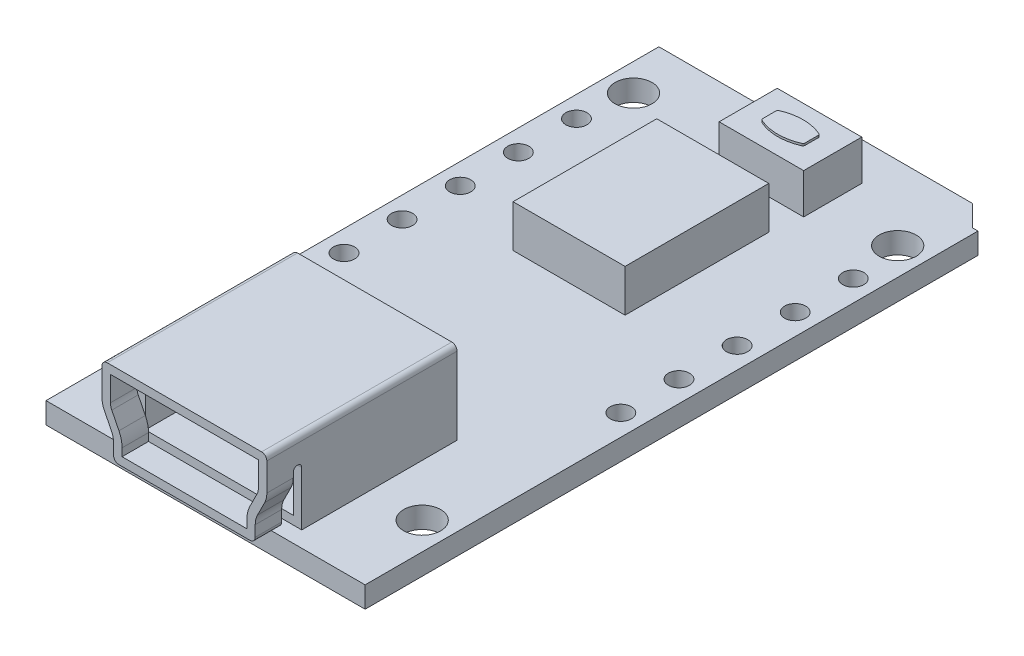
ISO-10303-21;
HEADER;
FILE_DESCRIPTION(('STEP AP214'),'2;1');
FILE_NAME('part.step','',(''),(''),'','','');
FILE_SCHEMA(('AUTOMOTIVE_DESIGN { 1 0 10303 214 1 1 1 1 }'));
ENDSEC;
DATA;
#1=APPLICATION_CONTEXT('core data for automotive mechanical design processes');
#2=APPLICATION_PROTOCOL_DEFINITION('international standard','automotive_design',2000,#1);
#3=PRODUCT_CONTEXT('',#1,'mechanical');
#4=PRODUCT('Part','Part','',(#3));
#5=PRODUCT_RELATED_PRODUCT_CATEGORY('part','',(#4));
#6=PRODUCT_DEFINITION_FORMATION('','',#4);
#7=PRODUCT_DEFINITION_CONTEXT('part definition',#1,'design');
#8=PRODUCT_DEFINITION('design','',#6,#7);
#9=PRODUCT_DEFINITION_SHAPE('','',#8);
#10=(LENGTH_UNIT() NAMED_UNIT(*) SI_UNIT(.MILLI.,.METRE.));
#11=(NAMED_UNIT(*) PLANE_ANGLE_UNIT() SI_UNIT($,.RADIAN.));
#12=(NAMED_UNIT(*) SI_UNIT($,.STERADIAN.) SOLID_ANGLE_UNIT());
#13=UNCERTAINTY_MEASURE_WITH_UNIT(LENGTH_MEASURE(1.E-05),#10,'distance_accuracy_value','');
#14=(GEOMETRIC_REPRESENTATION_CONTEXT(3) GLOBAL_UNCERTAINTY_ASSIGNED_CONTEXT((#13)) GLOBAL_UNIT_ASSIGNED_CONTEXT((#10,
#11,#12)) REPRESENTATION_CONTEXT('',''));
#15=CARTESIAN_POINT('',(0.,0.,0.));
#16=DIRECTION('',(0.,0.,1.));
#17=DIRECTION('',(1.,0.,0.));
#18=AXIS2_PLACEMENT_3D('',#15,#16,#17);
#19=CARTESIAN_POINT('',(0.850000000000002,2.9,-10.0902777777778));
#20=DIRECTION('',(0.,-1.,0.));
#21=DIRECTION('',(0.,0.,-1.));
#22=AXIS2_PLACEMENT_3D('',#19,#20,#21);
#23=PLANE('',#22);
#24=CARTESIAN_POINT('',(0.850000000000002,2.9,-13.5597222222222));
#25=DIRECTION('',(0.,1.,0.));
#26=DIRECTION('',(0.,0.,1.));
#27=AXIS2_PLACEMENT_3D('',#24,#25,#26);
#28=CIRCLE('',#27,2.33472222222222);
#29=CARTESIAN_POINT('',(-0.0902734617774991,2.9,-11.4227117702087));
#30=VERTEX_POINT('',#29);
#31=CARTESIAN_POINT('',(1.7902734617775,2.9,-11.4227117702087));
#32=VERTEX_POINT('',#31);
#33=EDGE_CURVE('E119',#30,#32,#28,.T.);
#34=ORIENTED_EDGE('',*,*,#33,.F.);
#35=CARTESIAN_POINT('',(-0.0499999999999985,2.9,-11.5142434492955));
#36=DIRECTION('',(0.,-1.,0.));
#37=DIRECTION('',(0.,0.,-1.));
#38=AXIS2_PLACEMENT_3D('',#35,#36,#37);
#39=CIRCLE('',#38,0.1);
#40=CARTESIAN_POINT('',(-0.149999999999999,2.9,-11.5142434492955));
#41=VERTEX_POINT('',#40);
#42=EDGE_CURVE('E170',#30,#41,#39,.T.);
#43=ORIENTED_EDGE('',*,*,#42,.T.);
#44=DIRECTION('',(0.,0.,1.));
#45=VECTOR('',#44,1.);
#46=CARTESIAN_POINT('',(-0.149999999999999,2.9,-12.2));
#47=LINE('',#46,#45);
#48=CARTESIAN_POINT('',(-0.149999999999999,2.9,-12.1357565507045));
#49=VERTEX_POINT('',#48);
#50=EDGE_CURVE('E161',#49,#41,#47,.T.);
#51=ORIENTED_EDGE('',*,*,#50,.F.);
#52=CARTESIAN_POINT('',(-0.0499999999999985,2.9,-12.1357565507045));
#53=DIRECTION('',(0.,-1.,0.));
#54=DIRECTION('',(0.,0.,-1.));
#55=AXIS2_PLACEMENT_3D('',#52,#53,#54);
#56=CIRCLE('',#55,0.1);
#57=CARTESIAN_POINT('',(-0.0902734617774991,2.9,-12.2272882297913));
#58=VERTEX_POINT('',#57);
#59=EDGE_CURVE('E168',#49,#58,#56,.T.);
#60=ORIENTED_EDGE('',*,*,#59,.T.);
#61=CARTESIAN_POINT('',(0.850000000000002,2.9,-10.0902777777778));
#62=DIRECTION('',(0.,1.,0.));
#63=DIRECTION('',(0.,0.,-1.));
#64=AXIS2_PLACEMENT_3D('',#61,#62,#63);
#65=CIRCLE('',#64,2.33472222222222);
#66=CARTESIAN_POINT('',(1.7902734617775,2.9,-12.2272882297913));
#67=VERTEX_POINT('',#66);
#68=EDGE_CURVE('E181',#67,#58,#65,.T.);
#69=ORIENTED_EDGE('',*,*,#68,.F.);
#70=CARTESIAN_POINT('',(1.75,2.9,-12.1357565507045));
#71=DIRECTION('',(0.,-1.,0.));
#72=DIRECTION('',(0.,0.,-1.));
#73=AXIS2_PLACEMENT_3D('',#70,#71,#72);
#74=CIRCLE('',#73,0.1);
#75=CARTESIAN_POINT('',(1.85,2.9,-12.1357565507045));
#76=VERTEX_POINT('',#75);
#77=EDGE_CURVE('E158',#67,#76,#74,.T.);
#78=ORIENTED_EDGE('',*,*,#77,.T.);
#79=DIRECTION('',(0.,0.,-1.));
#80=VECTOR('',#79,1.);
#81=CARTESIAN_POINT('',(1.85,2.9,-12.2));
#82=LINE('',#81,#80);
#83=CARTESIAN_POINT('',(1.85,2.9,-11.5142434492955));
#84=VERTEX_POINT('',#83);
#85=EDGE_CURVE('E153',#84,#76,#82,.T.);
#86=ORIENTED_EDGE('',*,*,#85,.F.);
#87=CARTESIAN_POINT('',(1.75,2.9,-11.5142434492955));
#88=DIRECTION('',(0.,-1.,0.));
#89=DIRECTION('',(0.,0.,-1.));
#90=AXIS2_PLACEMENT_3D('',#87,#88,#89);
#91=CIRCLE('',#90,0.1);
#92=EDGE_CURVE('E156',#84,#32,#91,.T.);
#93=ORIENTED_EDGE('',*,*,#92,.T.);
#94=EDGE_LOOP('',(#34,#43,#51,#60,#69,#78,#86,#93));
#95=FACE_BOUND('',#94,.T.);
#96=ADVANCED_FACE('F45',(#95),#23,.T.);
#97=CARTESIAN_POINT('',(1.85,5.33238075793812,-12.2));
#98=DIRECTION('',(-1.,0.,0.));
#99=DIRECTION('',(0.,0.,1.));
#100=AXIS2_PLACEMENT_3D('',#97,#98,#99);
#101=PLANE('',#100);
#102=ORIENTED_EDGE('',*,*,#85,.T.);
#103=DIRECTION('',(0.,-1.,0.));
#104=VECTOR('',#103,1.);
#105=CARTESIAN_POINT('',(1.85,5.33238075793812,-12.1357565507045));
#106=LINE('',#105,#104);
#107=CARTESIAN_POINT('',(1.85,3.,-12.1357565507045));
#108=VERTEX_POINT('',#107);
#109=EDGE_CURVE('E12',#76,#108,#106,.F.);
#110=ORIENTED_EDGE('',*,*,#109,.T.);
#111=DIRECTION('',(0.,0.,1.));
#112=VECTOR('',#111,1.);
#113=CARTESIAN_POINT('',(1.85,3.,-12.2));
#114=LINE('',#113,#112);
#115=CARTESIAN_POINT('',(1.85,3.,-11.5142434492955));
#116=VERTEX_POINT('',#115);
#117=EDGE_CURVE('E132',#108,#116,#114,.T.);
#118=ORIENTED_EDGE('',*,*,#117,.T.);
#119=DIRECTION('',(0.,-1.,0.));
#120=VECTOR('',#119,1.);
#121=CARTESIAN_POINT('',(1.85,5.33238075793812,-11.5142434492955));
#122=LINE('',#121,#120);
#123=EDGE_CURVE('E53',#116,#84,#122,.T.);
#124=ORIENTED_EDGE('',*,*,#123,.T.);
#125=EDGE_LOOP('',(#102,#110,#118,#124));
#126=FACE_BOUND('',#125,.T.);
#127=ADVANCED_FACE('F152',(#126),#101,.F.);
#128=CARTESIAN_POINT('',(0.850000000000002,5.33238075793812,-13.5597222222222));
#129=DIRECTION('',(0.,-1.,0.));
#130=DIRECTION('',(0.,0.,-1.));
#131=AXIS2_PLACEMENT_3D('',#128,#129,#130);
#132=CYLINDRICAL_SURFACE('',#131,2.33472222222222);
#133=CARTESIAN_POINT('',(0.850000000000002,3.,-13.5597222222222));
#134=DIRECTION('',(0.,-1.,0.));
#135=DIRECTION('',(0.,0.,-1.));
#136=AXIS2_PLACEMENT_3D('',#133,#134,#135);
#137=CIRCLE('',#136,2.33472222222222);
#138=CARTESIAN_POINT('',(1.7902734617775,3.,-11.4227117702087));
#139=VERTEX_POINT('',#138);
#140=CARTESIAN_POINT('',(-0.0902734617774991,3.,-11.4227117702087));
#141=VERTEX_POINT('',#140);
#142=EDGE_CURVE('E116',#139,#141,#137,.T.);
#143=ORIENTED_EDGE('',*,*,#142,.T.);
#144=DIRECTION('',(0.,-1.,0.));
#145=VECTOR('',#144,1.);
#146=CARTESIAN_POINT('',(-0.0902734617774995,5.33238075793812,-11.4227117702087));
#147=LINE('',#146,#145);
#148=EDGE_CURVE('E122',#141,#30,#147,.T.);
#149=ORIENTED_EDGE('',*,*,#148,.T.);
#150=ORIENTED_EDGE('',*,*,#33,.T.);
#151=DIRECTION('',(0.,-1.,0.));
#152=VECTOR('',#151,1.);
#153=CARTESIAN_POINT('',(1.7902734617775,5.33238075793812,-11.4227117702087));
#154=LINE('',#153,#152);
#155=EDGE_CURVE('E112',#32,#139,#154,.F.);
#156=ORIENTED_EDGE('',*,*,#155,.T.);
#157=EDGE_LOOP('',(#143,#149,#150,#156));
#158=FACE_BOUND('',#157,.T.);
#159=ADVANCED_FACE('F114',(#158),#132,.T.);
#160=CARTESIAN_POINT('',(-0.149999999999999,5.33238075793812,-12.2));
#161=DIRECTION('',(1.,0.,0.));
#162=DIRECTION('',(0.,0.,-1.));
#163=AXIS2_PLACEMENT_3D('',#160,#161,#162);
#164=PLANE('',#163);
#165=ORIENTED_EDGE('',*,*,#50,.T.);
#166=DIRECTION('',(0.,-1.,0.));
#167=VECTOR('',#166,1.);
#168=CARTESIAN_POINT('',(-0.149999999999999,5.33238075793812,-11.5142434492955));
#169=LINE('',#168,#167);
#170=CARTESIAN_POINT('',(-0.149999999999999,3.,-11.5142434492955));
#171=VERTEX_POINT('',#170);
#172=EDGE_CURVE('E136',#41,#171,#169,.F.);
#173=ORIENTED_EDGE('',*,*,#172,.T.);
#174=DIRECTION('',(0.,0.,-1.));
#175=VECTOR('',#174,1.);
#176=CARTESIAN_POINT('',(-0.149999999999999,3.,-12.2));
#177=LINE('',#176,#175);
#178=CARTESIAN_POINT('',(-0.149999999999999,3.,-12.1357565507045));
#179=VERTEX_POINT('',#178);
#180=EDGE_CURVE('E131',#171,#179,#177,.T.);
#181=ORIENTED_EDGE('',*,*,#180,.T.);
#182=DIRECTION('',(0.,-1.,0.));
#183=VECTOR('',#182,1.);
#184=CARTESIAN_POINT('',(-0.149999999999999,5.33238075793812,-12.1357565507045));
#185=LINE('',#184,#183);
#186=EDGE_CURVE('E140',#179,#49,#185,.T.);
#187=ORIENTED_EDGE('',*,*,#186,.T.);
#188=EDGE_LOOP('',(#165,#173,#181,#187));
#189=FACE_BOUND('',#188,.T.);
#190=ADVANCED_FACE('F177',(#189),#164,.F.);
#191=CARTESIAN_POINT('',(0.850000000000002,5.33238075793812,-10.0902777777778));
#192=DIRECTION('',(0.,-1.,0.));
#193=DIRECTION('',(0.,0.,-1.));
#194=AXIS2_PLACEMENT_3D('',#191,#192,#193);
#195=CYLINDRICAL_SURFACE('',#194,2.33472222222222);
#196=ORIENTED_EDGE('',*,*,#68,.T.);
#197=DIRECTION('',(0.,-1.,0.));
#198=VECTOR('',#197,1.);
#199=CARTESIAN_POINT('',(-0.0902734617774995,5.33238075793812,-12.2272882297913));
#200=LINE('',#199,#198);
#201=CARTESIAN_POINT('',(-0.0902734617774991,3.,-12.2272882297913));
#202=VERTEX_POINT('',#201);
#203=EDGE_CURVE('E67',#58,#202,#200,.F.);
#204=ORIENTED_EDGE('',*,*,#203,.T.);
#205=CARTESIAN_POINT('',(0.850000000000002,3.,-10.0902777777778));
#206=DIRECTION('',(0.,-1.,0.));
#207=DIRECTION('',(0.,0.,-1.));
#208=AXIS2_PLACEMENT_3D('',#205,#206,#207);
#209=CIRCLE('',#208,2.33472222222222);
#210=CARTESIAN_POINT('',(1.7902734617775,3.,-12.2272882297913));
#211=VERTEX_POINT('',#210);
#212=EDGE_CURVE('E123',#202,#211,#209,.T.);
#213=ORIENTED_EDGE('',*,*,#212,.T.);
#214=DIRECTION('',(0.,-1.,0.));
#215=VECTOR('',#214,1.);
#216=CARTESIAN_POINT('',(1.7902734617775,5.33238075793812,-12.2272882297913));
#217=LINE('',#216,#215);
#218=EDGE_CURVE('E146',#211,#67,#217,.T.);
#219=ORIENTED_EDGE('',*,*,#218,.T.);
#220=EDGE_LOOP('',(#196,#204,#213,#219));
#221=FACE_BOUND('',#220,.T.);
#222=ADVANCED_FACE('F186',(#221),#195,.T.);
#223=CARTESIAN_POINT('',(0.,3.,0.));
#224=DIRECTION('',(0.,-1.,0.));
#225=DIRECTION('',(0.,0.,-1.));
#226=AXIS2_PLACEMENT_3D('',#223,#224,#225);
#227=PLANE('',#226);
#228=ORIENTED_EDGE('',*,*,#180,.F.);
#229=CARTESIAN_POINT('',(-0.0499999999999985,3.,-11.5142434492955));
#230=DIRECTION('',(0.,-1.,0.));
#231=DIRECTION('',(0.,0.,-1.));
#232=AXIS2_PLACEMENT_3D('',#229,#230,#231);
#233=CIRCLE('',#232,0.1);
#234=EDGE_CURVE('E130',#171,#141,#233,.F.);
#235=ORIENTED_EDGE('',*,*,#234,.T.);
#236=ORIENTED_EDGE('',*,*,#142,.F.);
#237=CARTESIAN_POINT('',(1.75,3.,-11.5142434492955));
#238=DIRECTION('',(0.,-1.,0.));
#239=DIRECTION('',(0.,0.,-1.));
#240=AXIS2_PLACEMENT_3D('',#237,#238,#239);
#241=CIRCLE('',#240,0.1);
#242=EDGE_CURVE('E127',#139,#116,#241,.F.);
#243=ORIENTED_EDGE('',*,*,#242,.T.);
#244=ORIENTED_EDGE('',*,*,#117,.F.);
#245=CARTESIAN_POINT('',(1.75,3.,-12.1357565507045));
#246=DIRECTION('',(0.,-1.,0.));
#247=DIRECTION('',(0.,0.,-1.));
#248=AXIS2_PLACEMENT_3D('',#245,#246,#247);
#249=CIRCLE('',#248,0.1);
#250=EDGE_CURVE('E60',#108,#211,#249,.F.);
#251=ORIENTED_EDGE('',*,*,#250,.T.);
#252=ORIENTED_EDGE('',*,*,#212,.F.);
#253=CARTESIAN_POINT('',(-0.0499999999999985,3.,-12.1357565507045));
#254=DIRECTION('',(0.,-1.,0.));
#255=DIRECTION('',(0.,0.,-1.));
#256=AXIS2_PLACEMENT_3D('',#253,#254,#255);
#257=CIRCLE('',#256,0.1);
#258=EDGE_CURVE('E138',#202,#179,#257,.F.);
#259=ORIENTED_EDGE('',*,*,#258,.T.);
#260=EDGE_LOOP('',(#228,#235,#236,#243,#244,#251,#252,#259));
#261=FACE_BOUND('',#260,.T.);
#262=ADVANCED_FACE('F126',(#261),#227,.F.);
#263=CARTESIAN_POINT('',(-0.0499999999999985,5.33238075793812,-11.5142434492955));
#264=DIRECTION('',(0.,-1.,0.));
#265=DIRECTION('',(0.,0.,-1.));
#266=AXIS2_PLACEMENT_3D('',#263,#264,#265);
#267=CYLINDRICAL_SURFACE('',#266,0.1);
#268=ORIENTED_EDGE('',*,*,#234,.F.);
#269=ORIENTED_EDGE('',*,*,#172,.F.);
#270=ORIENTED_EDGE('',*,*,#42,.F.);
#271=ORIENTED_EDGE('',*,*,#148,.F.);
#272=EDGE_LOOP('',(#268,#269,#270,#271));
#273=FACE_BOUND('',#272,.T.);
#274=ADVANCED_FACE('F195',(#273),#267,.T.);
#275=CARTESIAN_POINT('',(-0.0499999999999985,5.33238075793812,-12.1357565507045));
#276=DIRECTION('',(0.,-1.,0.));
#277=DIRECTION('',(0.,0.,-1.));
#278=AXIS2_PLACEMENT_3D('',#275,#276,#277);
#279=CYLINDRICAL_SURFACE('',#278,0.1);
#280=ORIENTED_EDGE('',*,*,#258,.F.);
#281=ORIENTED_EDGE('',*,*,#203,.F.);
#282=ORIENTED_EDGE('',*,*,#59,.F.);
#283=ORIENTED_EDGE('',*,*,#186,.F.);
#284=EDGE_LOOP('',(#280,#281,#282,#283));
#285=FACE_BOUND('',#284,.T.);
#286=ADVANCED_FACE('F190',(#285),#279,.T.);
#287=CARTESIAN_POINT('',(1.75,5.33238075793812,-12.1357565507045));
#288=DIRECTION('',(0.,-1.,0.));
#289=DIRECTION('',(0.,0.,-1.));
#290=AXIS2_PLACEMENT_3D('',#287,#288,#289);
#291=CYLINDRICAL_SURFACE('',#290,0.1);
#292=ORIENTED_EDGE('',*,*,#250,.F.);
#293=ORIENTED_EDGE('',*,*,#109,.F.);
#294=ORIENTED_EDGE('',*,*,#77,.F.);
#295=ORIENTED_EDGE('',*,*,#218,.F.);
#296=EDGE_LOOP('',(#292,#293,#294,#295));
#297=FACE_BOUND('',#296,.T.);
#298=ADVANCED_FACE('F188',(#297),#291,.T.);
#299=CARTESIAN_POINT('',(1.75,5.33238075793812,-11.5142434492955));
#300=DIRECTION('',(0.,-1.,0.));
#301=DIRECTION('',(0.,0.,-1.));
#302=AXIS2_PLACEMENT_3D('',#299,#300,#301);
#303=CYLINDRICAL_SURFACE('',#302,0.1);
#304=ORIENTED_EDGE('',*,*,#242,.F.);
#305=ORIENTED_EDGE('',*,*,#155,.F.);
#306=ORIENTED_EDGE('',*,*,#92,.F.);
#307=ORIENTED_EDGE('',*,*,#123,.F.);
#308=EDGE_LOOP('',(#304,#305,#306,#307));
#309=FACE_BOUND('',#308,.T.);
#310=ADVANCED_FACE('F47',(#309),#303,.T.);
#311=CLOSED_SHELL('',(#96,#127,#159,#190,#222,#262,#274,#286,#298,#310));
#312=MANIFOLD_SOLID_BREP('B2',#311);
#313=CARTESIAN_POINT('',(-1.15,2.9,-13.2));
#314=DIRECTION('',(1.,0.,0.));
#315=DIRECTION('',(0.,0.,-1.));
#316=AXIS2_PLACEMENT_3D('',#313,#314,#315);
#317=PLANE('',#316);
#318=DIRECTION('',(0.,0.,1.));
#319=VECTOR('',#318,1.);
#320=CARTESIAN_POINT('',(-1.15,1.,-13.2));
#321=LINE('',#320,#319);
#322=CARTESIAN_POINT('',(-1.15,1.,-13.2));
#323=VERTEX_POINT('',#322);
#324=CARTESIAN_POINT('',(-1.15,1.,-10.45));
#325=VERTEX_POINT('',#324);
#326=EDGE_CURVE('E345',#323,#325,#321,.T.);
#327=ORIENTED_EDGE('',*,*,#326,.T.);
#328=DIRECTION('',(0.,-1.,0.));
#329=VECTOR('',#328,1.);
#330=CARTESIAN_POINT('',(-1.15,2.9,-10.45));
#331=LINE('',#330,#329);
#332=CARTESIAN_POINT('',(-1.15,2.9,-10.45));
#333=VERTEX_POINT('',#332);
#334=EDGE_CURVE('E43',#333,#325,#331,.T.);
#335=ORIENTED_EDGE('',*,*,#334,.F.);
#336=DIRECTION('',(0.,0.,1.));
#337=VECTOR('',#336,1.);
#338=CARTESIAN_POINT('',(-1.15,2.9,-13.2));
#339=LINE('',#338,#337);
#340=CARTESIAN_POINT('',(-1.15,2.9,-13.2));
#341=VERTEX_POINT('',#340);
#342=EDGE_CURVE('E333',#341,#333,#339,.T.);
#343=ORIENTED_EDGE('',*,*,#342,.F.);
#344=DIRECTION('',(0.,-1.,0.));
#345=VECTOR('',#344,1.);
#346=CARTESIAN_POINT('',(-1.15,2.9,-13.2));
#347=LINE('',#346,#345);
#348=EDGE_CURVE('E341',#341,#323,#347,.T.);
#349=ORIENTED_EDGE('',*,*,#348,.T.);
#350=EDGE_LOOP('',(#327,#335,#343,#349));
#351=FACE_BOUND('',#350,.T.);
#352=ADVANCED_FACE('F282',(#351),#317,.F.);
#353=CARTESIAN_POINT('',(-1.15,2.9,-10.45));
#354=DIRECTION('',(0.,0.,-1.));
#355=DIRECTION('',(-1.,0.,0.));
#356=AXIS2_PLACEMENT_3D('',#353,#354,#355);
#357=PLANE('',#356);
#358=DIRECTION('',(1.,0.,0.));
#359=VECTOR('',#358,1.);
#360=CARTESIAN_POINT('',(-1.15,1.,-10.45));
#361=LINE('',#360,#359);
#362=CARTESIAN_POINT('',(2.85,1.,-10.45));
#363=VERTEX_POINT('',#362);
#364=EDGE_CURVE('E337',#325,#363,#361,.T.);
#365=ORIENTED_EDGE('',*,*,#364,.T.);
#366=DIRECTION('',(0.,-1.,0.));
#367=VECTOR('',#366,1.);
#368=CARTESIAN_POINT('',(2.85,2.9,-10.45));
#369=LINE('',#368,#367);
#370=CARTESIAN_POINT('',(2.85,2.9,-10.45));
#371=VERTEX_POINT('',#370);
#372=EDGE_CURVE('E290',#371,#363,#369,.T.);
#373=ORIENTED_EDGE('',*,*,#372,.F.);
#374=DIRECTION('',(1.,0.,0.));
#375=VECTOR('',#374,1.);
#376=CARTESIAN_POINT('',(-1.15,2.9,-10.45));
#377=LINE('',#376,#375);
#378=EDGE_CURVE('E328',#333,#371,#377,.T.);
#379=ORIENTED_EDGE('',*,*,#378,.F.);
#380=ORIENTED_EDGE('',*,*,#334,.T.);
#381=EDGE_LOOP('',(#365,#373,#379,#380));
#382=FACE_BOUND('',#381,.T.);
#383=ADVANCED_FACE('F336',(#382),#357,.F.);
#384=CARTESIAN_POINT('',(2.85,2.9,-13.2));
#385=DIRECTION('',(-1.,0.,0.));
#386=DIRECTION('',(0.,0.,1.));
#387=AXIS2_PLACEMENT_3D('',#384,#385,#386);
#388=PLANE('',#387);
#389=DIRECTION('',(0.,0.,-1.));
#390=VECTOR('',#389,1.);
#391=CARTESIAN_POINT('',(2.85,1.,-13.2));
#392=LINE('',#391,#390);
#393=CARTESIAN_POINT('',(2.85,1.,-13.2));
#394=VERTEX_POINT('',#393);
#395=EDGE_CURVE('E315',#363,#394,#392,.T.);
#396=ORIENTED_EDGE('',*,*,#395,.T.);
#397=DIRECTION('',(0.,-1.,0.));
#398=VECTOR('',#397,1.);
#399=CARTESIAN_POINT('',(2.85,2.9,-13.2));
#400=LINE('',#399,#398);
#401=CARTESIAN_POINT('',(2.85,2.9,-13.2));
#402=VERTEX_POINT('',#401);
#403=EDGE_CURVE('E338',#402,#394,#400,.T.);
#404=ORIENTED_EDGE('',*,*,#403,.F.);
#405=DIRECTION('',(0.,0.,-1.));
#406=VECTOR('',#405,1.);
#407=CARTESIAN_POINT('',(2.85,2.9,-13.2));
#408=LINE('',#407,#406);
#409=EDGE_CURVE('E331',#371,#402,#408,.T.);
#410=ORIENTED_EDGE('',*,*,#409,.F.);
#411=ORIENTED_EDGE('',*,*,#372,.T.);
#412=EDGE_LOOP('',(#396,#404,#410,#411));
#413=FACE_BOUND('',#412,.T.);
#414=ADVANCED_FACE('F339',(#413),#388,.F.);
#415=CARTESIAN_POINT('',(-1.15,2.9,-13.2));
#416=DIRECTION('',(0.,0.,1.));
#417=DIRECTION('',(1.,0.,0.));
#418=AXIS2_PLACEMENT_3D('',#415,#416,#417);
#419=PLANE('',#418);
#420=DIRECTION('',(-1.,0.,0.));
#421=VECTOR('',#420,1.);
#422=CARTESIAN_POINT('',(-1.15,1.,-13.2));
#423=LINE('',#422,#421);
#424=EDGE_CURVE('E321',#394,#323,#423,.T.);
#425=ORIENTED_EDGE('',*,*,#424,.T.);
#426=ORIENTED_EDGE('',*,*,#348,.F.);
#427=DIRECTION('',(-1.,0.,0.));
#428=VECTOR('',#427,1.);
#429=CARTESIAN_POINT('',(-1.15,2.9,-13.2));
#430=LINE('',#429,#428);
#431=EDGE_CURVE('E298',#402,#341,#430,.T.);
#432=ORIENTED_EDGE('',*,*,#431,.F.);
#433=ORIENTED_EDGE('',*,*,#403,.T.);
#434=EDGE_LOOP('',(#425,#426,#432,#433));
#435=FACE_BOUND('',#434,.T.);
#436=ADVANCED_FACE('F352',(#435),#419,.F.);
#437=CARTESIAN_POINT('',(0.,2.9,0.));
#438=DIRECTION('',(0.,1.,0.));
#439=DIRECTION('',(0.,0.,1.));
#440=AXIS2_PLACEMENT_3D('',#437,#438,#439);
#441=PLANE('',#440);
#442=ORIENTED_EDGE('',*,*,#342,.T.);
#443=ORIENTED_EDGE('',*,*,#378,.T.);
#444=ORIENTED_EDGE('',*,*,#409,.T.);
#445=ORIENTED_EDGE('',*,*,#431,.T.);
#446=EDGE_LOOP('',(#442,#443,#444,#445));
#447=FACE_BOUND('',#446,.T.);
#448=ADVANCED_FACE('F329',(#447),#441,.T.);
#449=CARTESIAN_POINT('',(0.,1.,0.));
#450=DIRECTION('',(0.,1.,0.));
#451=DIRECTION('',(0.,0.,1.));
#452=AXIS2_PLACEMENT_3D('',#449,#450,#451);
#453=PLANE('',#452);
#454=ORIENTED_EDGE('',*,*,#326,.F.);
#455=ORIENTED_EDGE('',*,*,#424,.F.);
#456=ORIENTED_EDGE('',*,*,#395,.F.);
#457=ORIENTED_EDGE('',*,*,#364,.F.);
#458=EDGE_LOOP('',(#454,#455,#456,#457));
#459=FACE_BOUND('',#458,.T.);
#460=ADVANCED_FACE('F355',(#459),#453,.F.);
#461=CLOSED_SHELL('',(#352,#383,#414,#436,#448,#460));
#462=MANIFOLD_SOLID_BREP('B6',#461);
#463=CARTESIAN_POINT('',(2.65,3.,-2.2));
#464=DIRECTION('',(-1.,0.,0.));
#465=DIRECTION('',(0.,0.,1.));
#466=AXIS2_PLACEMENT_3D('',#463,#464,#465);
#467=PLANE('',#466);
#468=DIRECTION('',(0.,0.,-1.));
#469=VECTOR('',#468,1.);
#470=CARTESIAN_POINT('',(2.65,1.,-2.2));
#471=LINE('',#470,#469);
#472=CARTESIAN_POINT('',(2.65,1.,-2.2));
#473=VERTEX_POINT('',#472);
#474=CARTESIAN_POINT('',(2.65,1.,-9.00000000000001));
#475=VERTEX_POINT('',#474);
#476=EDGE_CURVE('E497',#473,#475,#471,.T.);
#477=ORIENTED_EDGE('',*,*,#476,.T.);
#478=DIRECTION('',(0.,-1.,0.));
#479=VECTOR('',#478,1.);
#480=CARTESIAN_POINT('',(2.65,3.,-9.00000000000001));
#481=LINE('',#480,#479);
#482=CARTESIAN_POINT('',(2.65,3.,-9.00000000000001));
#483=VERTEX_POINT('',#482);
#484=EDGE_CURVE('E280',#483,#475,#481,.T.);
#485=ORIENTED_EDGE('',*,*,#484,.F.);
#486=DIRECTION('',(0.,0.,-1.));
#487=VECTOR('',#486,1.);
#488=CARTESIAN_POINT('',(2.65,3.,-2.2));
#489=LINE('',#488,#487);
#490=CARTESIAN_POINT('',(2.65,3.,-2.2));
#491=VERTEX_POINT('',#490);
#492=EDGE_CURVE('E485',#491,#483,#489,.T.);
#493=ORIENTED_EDGE('',*,*,#492,.F.);
#494=DIRECTION('',(0.,-1.,0.));
#495=VECTOR('',#494,1.);
#496=CARTESIAN_POINT('',(2.65,3.,-2.2));
#497=LINE('',#496,#495);
#498=EDGE_CURVE('E493',#491,#473,#497,.T.);
#499=ORIENTED_EDGE('',*,*,#498,.T.);
#500=EDGE_LOOP('',(#477,#485,#493,#499));
#501=FACE_BOUND('',#500,.T.);
#502=ADVANCED_FACE('F434',(#501),#467,.F.);
#503=CARTESIAN_POINT('',(-2.65,3.,-9.00000000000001));
#504=DIRECTION('',(0.,0.,1.));
#505=DIRECTION('',(1.,0.,0.));
#506=AXIS2_PLACEMENT_3D('',#503,#504,#505);
#507=PLANE('',#506);
#508=DIRECTION('',(-1.,0.,0.));
#509=VECTOR('',#508,1.);
#510=CARTESIAN_POINT('',(-2.65,1.,-9.00000000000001));
#511=LINE('',#510,#509);
#512=CARTESIAN_POINT('',(-2.65,1.,-9.00000000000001));
#513=VERTEX_POINT('',#512);
#514=EDGE_CURVE('E489',#475,#513,#511,.T.);
#515=ORIENTED_EDGE('',*,*,#514,.T.);
#516=DIRECTION('',(0.,-1.,0.));
#517=VECTOR('',#516,1.);
#518=CARTESIAN_POINT('',(-2.65,3.,-9.00000000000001));
#519=LINE('',#518,#517);
#520=CARTESIAN_POINT('',(-2.65,3.,-9.00000000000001));
#521=VERTEX_POINT('',#520);
#522=EDGE_CURVE('E442',#521,#513,#519,.T.);
#523=ORIENTED_EDGE('',*,*,#522,.F.);
#524=DIRECTION('',(-1.,0.,0.));
#525=VECTOR('',#524,1.);
#526=CARTESIAN_POINT('',(-2.65,3.,-9.00000000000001));
#527=LINE('',#526,#525);
#528=EDGE_CURVE('E480',#483,#521,#527,.T.);
#529=ORIENTED_EDGE('',*,*,#528,.F.);
#530=ORIENTED_EDGE('',*,*,#484,.T.);
#531=EDGE_LOOP('',(#515,#523,#529,#530));
#532=FACE_BOUND('',#531,.T.);
#533=ADVANCED_FACE('F488',(#532),#507,.F.);
#534=CARTESIAN_POINT('',(-2.65,3.,-2.2));
#535=DIRECTION('',(1.,0.,0.));
#536=DIRECTION('',(0.,0.,-1.));
#537=AXIS2_PLACEMENT_3D('',#534,#535,#536);
#538=PLANE('',#537);
#539=DIRECTION('',(0.,0.,1.));
#540=VECTOR('',#539,1.);
#541=CARTESIAN_POINT('',(-2.65,1.,-2.2));
#542=LINE('',#541,#540);
#543=CARTESIAN_POINT('',(-2.65,1.,-2.2));
#544=VERTEX_POINT('',#543);
#545=EDGE_CURVE('E467',#513,#544,#542,.T.);
#546=ORIENTED_EDGE('',*,*,#545,.T.);
#547=DIRECTION('',(0.,-1.,0.));
#548=VECTOR('',#547,1.);
#549=CARTESIAN_POINT('',(-2.65,3.,-2.2));
#550=LINE('',#549,#548);
#551=CARTESIAN_POINT('',(-2.65,3.,-2.2));
#552=VERTEX_POINT('',#551);
#553=EDGE_CURVE('E490',#552,#544,#550,.T.);
#554=ORIENTED_EDGE('',*,*,#553,.F.);
#555=DIRECTION('',(0.,0.,1.));
#556=VECTOR('',#555,1.);
#557=CARTESIAN_POINT('',(-2.65,3.,-2.2));
#558=LINE('',#557,#556);
#559=EDGE_CURVE('E483',#521,#552,#558,.T.);
#560=ORIENTED_EDGE('',*,*,#559,.F.);
#561=ORIENTED_EDGE('',*,*,#522,.T.);
#562=EDGE_LOOP('',(#546,#554,#560,#561));
#563=FACE_BOUND('',#562,.T.);
#564=ADVANCED_FACE('F491',(#563),#538,.F.);
#565=CARTESIAN_POINT('',(-2.65,3.,-2.2));
#566=DIRECTION('',(0.,0.,-1.));
#567=DIRECTION('',(-1.,0.,0.));
#568=AXIS2_PLACEMENT_3D('',#565,#566,#567);
#569=PLANE('',#568);
#570=DIRECTION('',(1.,0.,0.));
#571=VECTOR('',#570,1.);
#572=CARTESIAN_POINT('',(-2.65,1.,-2.2));
#573=LINE('',#572,#571);
#574=EDGE_CURVE('E473',#544,#473,#573,.T.);
#575=ORIENTED_EDGE('',*,*,#574,.T.);
#576=ORIENTED_EDGE('',*,*,#498,.F.);
#577=DIRECTION('',(1.,0.,0.));
#578=VECTOR('',#577,1.);
#579=CARTESIAN_POINT('',(-2.65,3.,-2.2));
#580=LINE('',#579,#578);
#581=EDGE_CURVE('E450',#552,#491,#580,.T.);
#582=ORIENTED_EDGE('',*,*,#581,.F.);
#583=ORIENTED_EDGE('',*,*,#553,.T.);
#584=EDGE_LOOP('',(#575,#576,#582,#583));
#585=FACE_BOUND('',#584,.T.);
#586=ADVANCED_FACE('F504',(#585),#569,.F.);
#587=CARTESIAN_POINT('',(0.,3.,0.));
#588=DIRECTION('',(0.,-1.,0.));
#589=DIRECTION('',(0.,0.,-1.));
#590=AXIS2_PLACEMENT_3D('',#587,#588,#589);
#591=PLANE('',#590);
#592=ORIENTED_EDGE('',*,*,#492,.T.);
#593=ORIENTED_EDGE('',*,*,#528,.T.);
#594=ORIENTED_EDGE('',*,*,#559,.T.);
#595=ORIENTED_EDGE('',*,*,#581,.T.);
#596=EDGE_LOOP('',(#592,#593,#594,#595));
#597=FACE_BOUND('',#596,.T.);
#598=ADVANCED_FACE('F481',(#597),#591,.F.);
#599=CARTESIAN_POINT('',(0.,1.,0.));
#600=DIRECTION('',(0.,-1.,0.));
#601=DIRECTION('',(0.,0.,-1.));
#602=AXIS2_PLACEMENT_3D('',#599,#600,#601);
#603=PLANE('',#602);
#604=ORIENTED_EDGE('',*,*,#476,.F.);
#605=ORIENTED_EDGE('',*,*,#574,.F.);
#606=ORIENTED_EDGE('',*,*,#545,.F.);
#607=ORIENTED_EDGE('',*,*,#514,.F.);
#608=EDGE_LOOP('',(#604,#605,#606,#607));
#609=FACE_BOUND('',#608,.T.);
#610=ADVANCED_FACE('F507',(#609),#603,.T.);
#611=CLOSED_SHELL('',(#502,#533,#564,#586,#598,#610));
#612=MANIFOLD_SOLID_BREP('B37',#611);
#613=CARTESIAN_POINT('',(-3.35,1.1,14.75));
#614=DIRECTION('',(0.,-1.,0.));
#615=DIRECTION('',(0.,0.,-1.));
#616=AXIS2_PLACEMENT_3D('',#613,#614,#615);
#617=PLANE('',#616);
#618=DIRECTION('',(1.,0.,0.));
#619=VECTOR('',#618,1.);
#620=CARTESIAN_POINT('',(-4.85,1.1,14.75));
#621=LINE('',#620,#619);
#622=CARTESIAN_POINT('',(-3.1,1.1,14.75));
#623=VERTEX_POINT('',#622);
#624=CARTESIAN_POINT('',(3.1,1.1,14.75));
#625=VERTEX_POINT('',#624);
#626=EDGE_CURVE('E839',#623,#625,#621,.T.);
#627=ORIENTED_EDGE('',*,*,#626,.T.);
#628=DIRECTION('',(0.,0.,1.));
#629=VECTOR('',#628,1.);
#630=CARTESIAN_POINT('',(3.1,1.1,14.75));
#631=LINE('',#630,#629);
#632=CARTESIAN_POINT('',(3.1,1.1,16.));
#633=VERTEX_POINT('',#632);
#634=EDGE_CURVE('E925',#625,#633,#631,.T.);
#635=ORIENTED_EDGE('',*,*,#634,.T.);
#636=DIRECTION('',(1.,0.,0.));
#637=VECTOR('',#636,1.);
#638=CARTESIAN_POINT('',(-3.35,1.1,16.));
#639=LINE('',#638,#637);
#640=CARTESIAN_POINT('',(-3.1,1.1,16.));
#641=VERTEX_POINT('',#640);
#642=EDGE_CURVE('E855',#641,#633,#639,.T.);
#643=ORIENTED_EDGE('',*,*,#642,.F.);
#644=DIRECTION('',(0.,0.,1.));
#645=VECTOR('',#644,1.);
#646=CARTESIAN_POINT('',(-3.1,1.1,14.75));
#647=LINE('',#646,#645);
#648=EDGE_CURVE('E922',#641,#623,#647,.F.);
#649=ORIENTED_EDGE('',*,*,#648,.T.);
#650=EDGE_LOOP('',(#627,#635,#643,#649));
#651=FACE_BOUND('',#650,.T.);
#652=ADVANCED_FACE('F566',(#651),#617,.T.);
#653=CARTESIAN_POINT('',(-3.35,1.5,14.75));
#654=DIRECTION('',(0.,-1.,0.));
#655=DIRECTION('',(0.,0.,-1.));
#656=AXIS2_PLACEMENT_3D('',#653,#654,#655);
#657=PLANE('',#656);
#658=DIRECTION('',(0.,0.,-1.));
#659=VECTOR('',#658,1.);
#660=CARTESIAN_POINT('',(2.95,1.5,14.75));
#661=LINE('',#660,#659);
#662=CARTESIAN_POINT('',(2.95,1.5,16.));
#663=VERTEX_POINT('',#662);
#664=CARTESIAN_POINT('',(2.95,1.5,14.75));
#665=VERTEX_POINT('',#664);
#666=EDGE_CURVE('E1082',#663,#665,#661,.T.);
#667=ORIENTED_EDGE('',*,*,#666,.T.);
#668=DIRECTION('',(-1.,0.,0.));
#669=VECTOR('',#668,1.);
#670=CARTESIAN_POINT('',(-3.35,1.5,14.75));
#671=LINE('',#670,#669);
#672=CARTESIAN_POINT('',(-2.95,1.5,14.75));
#673=VERTEX_POINT('',#672);
#674=EDGE_CURVE('E1044',#665,#673,#671,.T.);
#675=ORIENTED_EDGE('',*,*,#674,.T.);
#676=DIRECTION('',(0.,0.,-1.));
#677=VECTOR('',#676,1.);
#678=CARTESIAN_POINT('',(-2.95,1.5,14.75));
#679=LINE('',#678,#677);
#680=CARTESIAN_POINT('',(-2.95,1.5,16.));
#681=VERTEX_POINT('',#680);
#682=EDGE_CURVE('E1086',#681,#673,#679,.T.);
#683=ORIENTED_EDGE('',*,*,#682,.F.);
#684=DIRECTION('',(1.,0.,0.));
#685=VECTOR('',#684,1.);
#686=CARTESIAN_POINT('',(0.,1.5,16.));
#687=LINE('',#686,#685);
#688=EDGE_CURVE('E1099',#681,#663,#687,.T.);
#689=ORIENTED_EDGE('',*,*,#688,.T.);
#690=EDGE_LOOP('',(#667,#675,#683,#689));
#691=FACE_BOUND('',#690,.T.);
#692=ADVANCED_FACE('F1206',(#691),#657,.F.);
#693=DIRECTION('',(1.,0.,0.));
#694=VECTOR('',#693,1.);
#695=CARTESIAN_POINT('',(-4.85,1.1,14.35));
#696=LINE('',#695,#694);
#697=CARTESIAN_POINT('',(-3.9,1.1,14.35));
#698=VERTEX_POINT('',#697);
#699=CARTESIAN_POINT('',(3.9,1.1,14.35));
#700=VERTEX_POINT('',#699);
#701=EDGE_CURVE('E825',#698,#700,#696,.T.);
#702=ORIENTED_EDGE('',*,*,#701,.F.);
#703=DIRECTION('',(0.,0.,1.));
#704=VECTOR('',#703,1.);
#705=CARTESIAN_POINT('',(-3.9,1.1,7.));
#706=LINE('',#705,#704);
#707=CARTESIAN_POINT('',(-3.9,1.1,7.));
#708=VERTEX_POINT('',#707);
#709=EDGE_CURVE('E856',#708,#698,#706,.T.);
#710=ORIENTED_EDGE('',*,*,#709,.F.);
#711=DIRECTION('',(-1.,0.,0.));
#712=VECTOR('',#711,1.);
#713=CARTESIAN_POINT('',(3.9,1.1,7.));
#714=LINE('',#713,#712);
#715=CARTESIAN_POINT('',(3.9,1.1,7.));
#716=VERTEX_POINT('',#715);
#717=EDGE_CURVE('E854',#716,#708,#714,.T.);
#718=ORIENTED_EDGE('',*,*,#717,.F.);
#719=DIRECTION('',(0.,0.,1.));
#720=VECTOR('',#719,1.);
#721=CARTESIAN_POINT('',(3.9,1.1,7.));
#722=LINE('',#721,#720);
#723=EDGE_CURVE('E846',#716,#700,#722,.T.);
#724=ORIENTED_EDGE('',*,*,#723,.T.);
#725=EDGE_LOOP('',(#702,#710,#718,#724));
#726=FACE_BOUND('',#725,.T.);
#727=ADVANCED_FACE('F853',(#726),#617,.T.);
#728=CARTESIAN_POINT('',(-3.35,1.1,14.75));
#729=DIRECTION('',(-1.,0.,0.));
#730=DIRECTION('',(0.,0.,1.));
#731=AXIS2_PLACEMENT_3D('',#728,#729,#730);
#732=PLANE('',#731);
#733=DIRECTION('',(0.,-1.,0.));
#734=VECTOR('',#733,1.);
#735=CARTESIAN_POINT('',(-3.35,1.1,16.));
#736=LINE('',#735,#734);
#737=CARTESIAN_POINT('',(-3.35,1.86393202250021,16.));
#738=VERTEX_POINT('',#737);
#739=CARTESIAN_POINT('',(-3.35,1.35,16.));
#740=VERTEX_POINT('',#739);
#741=EDGE_CURVE('E880',#738,#740,#736,.T.);
#742=ORIENTED_EDGE('',*,*,#741,.F.);
#743=DIRECTION('',(0.,0.,1.));
#744=VECTOR('',#743,1.);
#745=CARTESIAN_POINT('',(-3.35,1.86393202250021,14.75));
#746=LINE('',#745,#744);
#747=CARTESIAN_POINT('',(-3.35,1.86393202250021,14.75));
#748=VERTEX_POINT('',#747);
#749=EDGE_CURVE('E971',#738,#748,#746,.F.);
#750=ORIENTED_EDGE('',*,*,#749,.T.);
#751=DIRECTION('',(0.,-1.,0.));
#752=VECTOR('',#751,1.);
#753=CARTESIAN_POINT('',(-3.35,1.1,14.75));
#754=LINE('',#753,#752);
#755=CARTESIAN_POINT('',(-3.35,1.35,14.75));
#756=VERTEX_POINT('',#755);
#757=EDGE_CURVE('E917',#748,#756,#754,.T.);
#758=ORIENTED_EDGE('',*,*,#757,.T.);
#759=DIRECTION('',(0.,0.,1.));
#760=VECTOR('',#759,1.);
#761=CARTESIAN_POINT('',(-3.35,1.35,14.75));
#762=LINE('',#761,#760);
#763=EDGE_CURVE('E941',#756,#740,#762,.T.);
#764=ORIENTED_EDGE('',*,*,#763,.T.);
#765=EDGE_LOOP('',(#742,#750,#758,#764));
#766=FACE_BOUND('',#765,.T.);
#767=ADVANCED_FACE('F969',(#766),#732,.T.);
#768=CARTESIAN_POINT('',(-3.35,2.1,14.75));
#769=DIRECTION('',(-0.894427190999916,-0.447213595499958,0.));
#770=DIRECTION('',(0.447213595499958,-0.894427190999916,0.));
#771=AXIS2_PLACEMENT_3D('',#768,#769,#770);
#772=PLANE('',#771);
#773=DIRECTION('',(0.447213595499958,-0.894427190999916,0.));
#774=VECTOR('',#773,1.);
#775=CARTESIAN_POINT('',(-3.35,2.1,14.75));
#776=LINE('',#775,#774);
#777=CARTESIAN_POINT('',(-3.79442719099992,2.98885438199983,14.75));
#778=VERTEX_POINT('',#777);
#779=CARTESIAN_POINT('',(-3.45557280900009,2.31114561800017,14.75));
#780=VERTEX_POINT('',#779);
#781=EDGE_CURVE('E892',#778,#780,#776,.T.);
#782=ORIENTED_EDGE('',*,*,#781,.T.);
#783=DIRECTION('',(0.,0.,1.));
#784=VECTOR('',#783,1.);
#785=CARTESIAN_POINT('',(-3.45557280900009,2.31114561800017,16.));
#786=LINE('',#785,#784);
#787=CARTESIAN_POINT('',(-3.45557280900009,2.31114561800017,16.));
#788=VERTEX_POINT('',#787);
#789=EDGE_CURVE('E1555',#780,#788,#786,.T.);
#790=ORIENTED_EDGE('',*,*,#789,.T.);
#791=DIRECTION('',(0.447213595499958,-0.894427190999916,0.));
#792=VECTOR('',#791,1.);
#793=CARTESIAN_POINT('',(-3.35,2.1,16.));
#794=LINE('',#793,#792);
#795=CARTESIAN_POINT('',(-3.79442719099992,2.98885438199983,16.));
#796=VERTEX_POINT('',#795);
#797=EDGE_CURVE('E877',#796,#788,#794,.T.);
#798=ORIENTED_EDGE('',*,*,#797,.F.);
#799=DIRECTION('',(0.,0.,1.));
#800=VECTOR('',#799,1.);
#801=CARTESIAN_POINT('',(-3.79442719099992,2.98885438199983,14.75));
#802=LINE('',#801,#800);
#803=EDGE_CURVE('E913',#796,#778,#802,.F.);
#804=ORIENTED_EDGE('',*,*,#803,.T.);
#805=EDGE_LOOP('',(#782,#790,#798,#804));
#806=FACE_BOUND('',#805,.T.);
#807=ADVANCED_FACE('F1219',(#806),#772,.T.);
#808=CARTESIAN_POINT('',(-3.9,3.2,14.75));
#809=DIRECTION('',(-1.,0.,0.));
#810=DIRECTION('',(0.,-1.,0.));
#811=AXIS2_PLACEMENT_3D('',#808,#809,#810);
#812=PLANE('',#811);
#813=DIRECTION('',(0.,1.,0.));
#814=VECTOR('',#813,1.);
#815=CARTESIAN_POINT('',(-3.9,3.2,14.75));
#816=LINE('',#815,#814);
#817=CARTESIAN_POINT('',(-3.9,3.43606797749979,14.75));
#818=VERTEX_POINT('',#817);
#819=CARTESIAN_POINT('',(-3.9,3.65999999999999,14.75));
#820=VERTEX_POINT('',#819);
#821=EDGE_CURVE('E1060',#818,#820,#816,.T.);
#822=ORIENTED_EDGE('',*,*,#821,.F.);
#823=DIRECTION('',(0.,0.,1.));
#824=VECTOR('',#823,1.);
#825=CARTESIAN_POINT('',(-3.9,3.43606797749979,14.75));
#826=LINE('',#825,#824);
#827=CARTESIAN_POINT('',(-3.9,3.43606797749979,16.));
#828=VERTEX_POINT('',#827);
#829=EDGE_CURVE('E999',#818,#828,#826,.T.);
#830=ORIENTED_EDGE('',*,*,#829,.T.);
#831=DIRECTION('',(0.,-1.,0.));
#832=VECTOR('',#831,1.);
#833=CARTESIAN_POINT('',(-3.9,3.2,16.));
#834=LINE('',#833,#832);
#835=CARTESIAN_POINT('',(-3.9,4.75,16.));
#836=VERTEX_POINT('',#835);
#837=EDGE_CURVE('E874',#836,#828,#834,.T.);
#838=ORIENTED_EDGE('',*,*,#837,.F.);
#839=DIRECTION('',(0.,0.,1.));
#840=VECTOR('',#839,1.);
#841=CARTESIAN_POINT('',(-3.9,4.75,14.75));
#842=LINE('',#841,#840);
#843=CARTESIAN_POINT('',(-3.9,4.75,7.));
#844=VERTEX_POINT('',#843);
#845=EDGE_CURVE('E956',#836,#844,#842,.F.);
#846=ORIENTED_EDGE('',*,*,#845,.T.);
#847=DIRECTION('',(0.,1.,0.));
#848=VECTOR('',#847,1.);
#849=CARTESIAN_POINT('',(-3.9,1.1,7.));
#850=LINE('',#849,#848);
#851=EDGE_CURVE('E1158',#708,#844,#850,.T.);
#852=ORIENTED_EDGE('',*,*,#851,.F.);
#853=ORIENTED_EDGE('',*,*,#709,.T.);
#854=DIRECTION('',(0.,-1.,0.));
#855=VECTOR('',#854,1.);
#856=CARTESIAN_POINT('',(-3.9,3.2,14.35));
#857=LINE('',#856,#855);
#858=CARTESIAN_POINT('',(-3.9,3.65999999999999,14.35));
#859=VERTEX_POINT('',#858);
#860=EDGE_CURVE('E833',#859,#698,#857,.T.);
#861=ORIENTED_EDGE('',*,*,#860,.F.);
#862=CARTESIAN_POINT('',(-3.9,3.66,14.54));
#863=DIRECTION('',(-1.,0.,0.));
#864=DIRECTION('',(0.,-1.,0.));
#865=AXIS2_PLACEMENT_3D('',#862,#863,#864);
#866=CIRCLE('',#865,0.19);
#867=CARTESIAN_POINT('',(-3.9,3.85,14.54));
#868=VERTEX_POINT('',#867);
#869=EDGE_CURVE('E1065',#868,#859,#866,.T.);
#870=ORIENTED_EDGE('',*,*,#869,.F.);
#871=DIRECTION('',(0.,0.,-1.));
#872=VECTOR('',#871,1.);
#873=CARTESIAN_POINT('',(-3.9,3.85,14.75));
#874=LINE('',#873,#872);
#875=CARTESIAN_POINT('',(-3.9,3.85,14.56));
#876=VERTEX_POINT('',#875);
#877=EDGE_CURVE('E1070',#876,#868,#874,.T.);
#878=ORIENTED_EDGE('',*,*,#877,.F.);
#879=CARTESIAN_POINT('',(-3.9,3.66,14.56));
#880=DIRECTION('',(-1.,0.,0.));
#881=DIRECTION('',(0.,-1.,0.));
#882=AXIS2_PLACEMENT_3D('',#879,#880,#881);
#883=CIRCLE('',#882,0.19);
#884=EDGE_CURVE('E1075',#820,#876,#883,.T.);
#885=ORIENTED_EDGE('',*,*,#884,.F.);
#886=EDGE_LOOP('',(#822,#830,#838,#846,#852,#853,#861,#870,#878,#885));
#887=FACE_BOUND('',#886,.T.);
#888=ADVANCED_FACE('F1172',(#887),#812,.T.);
#889=CARTESIAN_POINT('',(-3.9,5.,14.75));
#890=DIRECTION('',(0.,1.,0.));
#891=DIRECTION('',(0.,0.,1.));
#892=AXIS2_PLACEMENT_3D('',#889,#890,#891);
#893=PLANE('',#892);
#894=DIRECTION('',(-1.,0.,0.));
#895=VECTOR('',#894,1.);
#896=CARTESIAN_POINT('',(-3.9,5.,16.));
#897=LINE('',#896,#895);
#898=CARTESIAN_POINT('',(3.65,5.,16.));
#899=VERTEX_POINT('',#898);
#900=CARTESIAN_POINT('',(-3.65,5.,16.));
#901=VERTEX_POINT('',#900);
#902=EDGE_CURVE('E871',#899,#901,#897,.T.);
#903=ORIENTED_EDGE('',*,*,#902,.F.);
#904=DIRECTION('',(0.,0.,1.));
#905=VECTOR('',#904,1.);
#906=CARTESIAN_POINT('',(3.65,5.,14.75));
#907=LINE('',#906,#905);
#908=CARTESIAN_POINT('',(3.65,5.,7.));
#909=VERTEX_POINT('',#908);
#910=EDGE_CURVE('E950',#899,#909,#907,.F.);
#911=ORIENTED_EDGE('',*,*,#910,.T.);
#912=DIRECTION('',(1.,0.,0.));
#913=VECTOR('',#912,1.);
#914=CARTESIAN_POINT('',(3.9,5.,7.));
#915=LINE('',#914,#913);
#916=CARTESIAN_POINT('',(-3.65,5.,7.));
#917=VERTEX_POINT('',#916);
#918=EDGE_CURVE('E1162',#917,#909,#915,.T.);
#919=ORIENTED_EDGE('',*,*,#918,.F.);
#920=DIRECTION('',(0.,0.,1.));
#921=VECTOR('',#920,1.);
#922=CARTESIAN_POINT('',(-3.65,5.,14.75));
#923=LINE('',#922,#921);
#924=EDGE_CURVE('E947',#917,#901,#923,.T.);
#925=ORIENTED_EDGE('',*,*,#924,.T.);
#926=EDGE_LOOP('',(#903,#911,#919,#925));
#927=FACE_BOUND('',#926,.T.);
#928=ADVANCED_FACE('F1183',(#927),#893,.T.);
#929=CARTESIAN_POINT('',(3.9,3.2,14.75));
#930=DIRECTION('',(1.,0.,0.));
#931=DIRECTION('',(0.,1.,0.));
#932=AXIS2_PLACEMENT_3D('',#929,#930,#931);
#933=PLANE('',#932);
#934=DIRECTION('',(0.,-1.,0.));
#935=VECTOR('',#934,1.);
#936=CARTESIAN_POINT('',(3.9,1.1,14.75));
#937=LINE('',#936,#935);
#938=CARTESIAN_POINT('',(3.9,3.66,14.75));
#939=VERTEX_POINT('',#938);
#940=CARTESIAN_POINT('',(3.9,3.43606797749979,14.75));
#941=VERTEX_POINT('',#940);
#942=EDGE_CURVE('E851',#939,#941,#937,.T.);
#943=ORIENTED_EDGE('',*,*,#942,.F.);
#944=CARTESIAN_POINT('',(3.9,3.66,14.56));
#945=DIRECTION('',(1.,0.,0.));
#946=DIRECTION('',(0.,-1.,0.));
#947=AXIS2_PLACEMENT_3D('',#944,#945,#946);
#948=CIRCLE('',#947,0.19);
#949=CARTESIAN_POINT('',(3.9,3.85,14.56));
#950=VERTEX_POINT('',#949);
#951=EDGE_CURVE('E1032',#950,#939,#948,.T.);
#952=ORIENTED_EDGE('',*,*,#951,.F.);
#953=DIRECTION('',(0.,0.,1.));
#954=VECTOR('',#953,1.);
#955=CARTESIAN_POINT('',(3.9,3.85,14.56));
#956=LINE('',#955,#954);
#957=CARTESIAN_POINT('',(3.9,3.85,14.54));
#958=VERTEX_POINT('',#957);
#959=EDGE_CURVE('E1539',#958,#950,#956,.T.);
#960=ORIENTED_EDGE('',*,*,#959,.F.);
#961=CARTESIAN_POINT('',(3.9,3.66,14.54));
#962=DIRECTION('',(1.,0.,0.));
#963=DIRECTION('',(0.,-1.,0.));
#964=AXIS2_PLACEMENT_3D('',#961,#962,#963);
#965=CIRCLE('',#964,0.19);
#966=CARTESIAN_POINT('',(3.9,3.66,14.35));
#967=VERTEX_POINT('',#966);
#968=EDGE_CURVE('E850',#967,#958,#965,.T.);
#969=ORIENTED_EDGE('',*,*,#968,.F.);
#970=DIRECTION('',(0.,1.,0.));
#971=VECTOR('',#970,1.);
#972=CARTESIAN_POINT('',(3.9,1.1,14.35));
#973=LINE('',#972,#971);
#974=EDGE_CURVE('E829',#700,#967,#973,.T.);
#975=ORIENTED_EDGE('',*,*,#974,.F.);
#976=ORIENTED_EDGE('',*,*,#723,.F.);
#977=DIRECTION('',(0.,-1.,0.));
#978=VECTOR('',#977,1.);
#979=CARTESIAN_POINT('',(3.9,1.1,7.));
#980=LINE('',#979,#978);
#981=CARTESIAN_POINT('',(3.9,4.75,7.));
#982=VERTEX_POINT('',#981);
#983=EDGE_CURVE('E1165',#982,#716,#980,.T.);
#984=ORIENTED_EDGE('',*,*,#983,.F.);
#985=DIRECTION('',(0.,0.,1.));
#986=VECTOR('',#985,1.);
#987=CARTESIAN_POINT('',(3.9,4.75,14.75));
#988=LINE('',#987,#986);
#989=CARTESIAN_POINT('',(3.9,4.75,16.));
#990=VERTEX_POINT('',#989);
#991=EDGE_CURVE('E944',#982,#990,#988,.T.);
#992=ORIENTED_EDGE('',*,*,#991,.T.);
#993=DIRECTION('',(0.,1.,0.));
#994=VECTOR('',#993,1.);
#995=CARTESIAN_POINT('',(3.9,3.2,16.));
#996=LINE('',#995,#994);
#997=CARTESIAN_POINT('',(3.9,3.43606797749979,16.));
#998=VERTEX_POINT('',#997);
#999=EDGE_CURVE('E869',#998,#990,#996,.T.);
#1000=ORIENTED_EDGE('',*,*,#999,.F.);
#1001=DIRECTION('',(0.,0.,1.));
#1002=VECTOR('',#1001,1.);
#1003=CARTESIAN_POINT('',(3.9,3.43606797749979,14.75));
#1004=LINE('',#1003,#1002);
#1005=EDGE_CURVE('E905',#998,#941,#1004,.F.);
#1006=ORIENTED_EDGE('',*,*,#1005,.T.);
#1007=EDGE_LOOP('',(#943,#952,#960,#969,#975,#976,#984,#992,#1000,#1006));
#1008=FACE_BOUND('',#1007,.T.);
#1009=ADVANCED_FACE('F844',(#1008),#933,.T.);
#1010=CARTESIAN_POINT('',(3.35,2.1,14.75));
#1011=DIRECTION('',(0.894427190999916,-0.447213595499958,0.));
#1012=DIRECTION('',(0.447213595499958,0.894427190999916,0.));
#1013=AXIS2_PLACEMENT_3D('',#1010,#1011,#1012);
#1014=PLANE('',#1013);
#1015=DIRECTION('',(0.447213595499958,0.894427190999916,0.));
#1016=VECTOR('',#1015,1.);
#1017=CARTESIAN_POINT('',(3.35,2.1,14.75));
#1018=LINE('',#1017,#1016);
#1019=CARTESIAN_POINT('',(3.45557280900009,2.31114561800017,14.75));
#1020=VERTEX_POINT('',#1019);
#1021=CARTESIAN_POINT('',(3.79442719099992,2.98885438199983,14.75));
#1022=VERTEX_POINT('',#1021);
#1023=EDGE_CURVE('E888',#1020,#1022,#1018,.T.);
#1024=ORIENTED_EDGE('',*,*,#1023,.T.);
#1025=DIRECTION('',(0.,0.,1.));
#1026=VECTOR('',#1025,1.);
#1027=CARTESIAN_POINT('',(3.79442719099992,2.98885438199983,14.75));
#1028=LINE('',#1027,#1026);
#1029=CARTESIAN_POINT('',(3.79442719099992,2.98885438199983,16.));
#1030=VERTEX_POINT('',#1029);
#1031=EDGE_CURVE('E898',#1022,#1030,#1028,.T.);
#1032=ORIENTED_EDGE('',*,*,#1031,.T.);
#1033=DIRECTION('',(0.447213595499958,0.894427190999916,0.));
#1034=VECTOR('',#1033,1.);
#1035=CARTESIAN_POINT('',(3.35,2.1,16.));
#1036=LINE('',#1035,#1034);
#1037=CARTESIAN_POINT('',(3.45557280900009,2.31114561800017,16.));
#1038=VERTEX_POINT('',#1037);
#1039=EDGE_CURVE('E866',#1038,#1030,#1036,.T.);
#1040=ORIENTED_EDGE('',*,*,#1039,.F.);
#1041=DIRECTION('',(0.,0.,1.));
#1042=VECTOR('',#1041,1.);
#1043=CARTESIAN_POINT('',(3.45557280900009,2.31114561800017,14.75));
#1044=LINE('',#1043,#1042);
#1045=EDGE_CURVE('E895',#1038,#1020,#1044,.F.);
#1046=ORIENTED_EDGE('',*,*,#1045,.T.);
#1047=EDGE_LOOP('',(#1024,#1032,#1040,#1046));
#1048=FACE_BOUND('',#1047,.T.);
#1049=ADVANCED_FACE('F1196',(#1048),#1014,.T.);
#1050=CARTESIAN_POINT('',(3.35,1.1,14.75));
#1051=DIRECTION('',(1.,0.,0.));
#1052=DIRECTION('',(0.,0.,-1.));
#1053=AXIS2_PLACEMENT_3D('',#1050,#1051,#1052);
#1054=PLANE('',#1053);
#1055=DIRECTION('',(0.,1.,0.));
#1056=VECTOR('',#1055,1.);
#1057=CARTESIAN_POINT('',(3.35,1.1,14.75));
#1058=LINE('',#1057,#1056);
#1059=CARTESIAN_POINT('',(3.35,1.35,14.75));
#1060=VERTEX_POINT('',#1059);
#1061=CARTESIAN_POINT('',(3.35,1.86393202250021,14.75));
#1062=VERTEX_POINT('',#1061);
#1063=EDGE_CURVE('E882',#1060,#1062,#1058,.T.);
#1064=ORIENTED_EDGE('',*,*,#1063,.T.);
#1065=DIRECTION('',(0.,0.,1.));
#1066=VECTOR('',#1065,1.);
#1067=CARTESIAN_POINT('',(3.35,1.86393202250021,16.));
#1068=LINE('',#1067,#1066);
#1069=CARTESIAN_POINT('',(3.35,1.86393202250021,16.));
#1070=VERTEX_POINT('',#1069);
#1071=EDGE_CURVE('E908',#1062,#1070,#1068,.T.);
#1072=ORIENTED_EDGE('',*,*,#1071,.T.);
#1073=DIRECTION('',(0.,1.,0.));
#1074=VECTOR('',#1073,1.);
#1075=CARTESIAN_POINT('',(3.35,1.1,16.));
#1076=LINE('',#1075,#1074);
#1077=CARTESIAN_POINT('',(3.35,1.35,16.));
#1078=VERTEX_POINT('',#1077);
#1079=EDGE_CURVE('E859',#1078,#1070,#1076,.T.);
#1080=ORIENTED_EDGE('',*,*,#1079,.F.);
#1081=DIRECTION('',(0.,0.,1.));
#1082=VECTOR('',#1081,1.);
#1083=CARTESIAN_POINT('',(3.35,1.35,14.75));
#1084=LINE('',#1083,#1082);
#1085=EDGE_CURVE('E936',#1078,#1060,#1084,.F.);
#1086=ORIENTED_EDGE('',*,*,#1085,.T.);
#1087=EDGE_LOOP('',(#1064,#1072,#1080,#1086));
#1088=FACE_BOUND('',#1087,.T.);
#1089=ADVANCED_FACE('F986',(#1088),#1054,.T.);
#1090=CARTESIAN_POINT('',(0.,0.,16.));
#1091=DIRECTION('',(0.,0.,1.));
#1092=DIRECTION('',(1.,0.,0.));
#1093=AXIS2_PLACEMENT_3D('',#1090,#1091,#1092);
#1094=PLANE('',#1093);
#1095=DIRECTION('',(0.447213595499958,0.894427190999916,0.));
#1096=VECTOR('',#1095,1.);
#1097=CARTESIAN_POINT('',(1.48222912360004,-0.741114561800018,16.));
#1098=LINE('',#1097,#1096);
#1099=CARTESIAN_POINT('',(3.09780193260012,2.49003105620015,16.));
#1100=VERTEX_POINT('',#1099);
#1101=CARTESIAN_POINT('',(3.43665631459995,3.16773982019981,16.));
#1102=VERTEX_POINT('',#1101);
#1103=EDGE_CURVE('E1139',#1100,#1102,#1098,.T.);
#1104=ORIENTED_EDGE('',*,*,#1103,.F.);
#1105=CARTESIAN_POINT('',(4.35,1.86393202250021,16.));
#1106=DIRECTION('',(0.,0.,1.));
#1107=DIRECTION('',(1.,0.,0.));
#1108=AXIS2_PLACEMENT_3D('',#1105,#1106,#1107);
#1109=CIRCLE('',#1108,1.4);
#1110=CARTESIAN_POINT('',(2.95,1.86393202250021,16.));
#1111=VERTEX_POINT('',#1110);
#1112=EDGE_CURVE('E1111',#1111,#1100,#1109,.F.);
#1113=ORIENTED_EDGE('',*,*,#1112,.F.);
#1114=DIRECTION('',(0.,1.,0.));
#1115=VECTOR('',#1114,1.);
#1116=CARTESIAN_POINT('',(2.95,0.,16.));
#1117=LINE('',#1116,#1115);
#1118=EDGE_CURVE('E1137',#663,#1111,#1117,.T.);
#1119=ORIENTED_EDGE('',*,*,#1118,.F.);
#1120=ORIENTED_EDGE('',*,*,#688,.F.);
#1121=DIRECTION('',(0.,-1.,0.));
#1122=VECTOR('',#1121,1.);
#1123=CARTESIAN_POINT('',(-2.95,0.,16.));
#1124=LINE('',#1123,#1122);
#1125=CARTESIAN_POINT('',(-2.95,1.86393202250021,16.));
#1126=VERTEX_POINT('',#1125);
#1127=EDGE_CURVE('E1089',#1126,#681,#1124,.T.);
#1128=ORIENTED_EDGE('',*,*,#1127,.F.);
#1129=CARTESIAN_POINT('',(-4.35,1.86393202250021,16.));
#1130=DIRECTION('',(0.,0.,1.));
#1131=DIRECTION('',(1.,0.,0.));
#1132=AXIS2_PLACEMENT_3D('',#1129,#1130,#1131);
#1133=CIRCLE('',#1132,1.4);
#1134=CARTESIAN_POINT('',(-3.09780193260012,2.49003105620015,16.));
#1135=VERTEX_POINT('',#1134);
#1136=EDGE_CURVE('E1141',#1135,#1126,#1133,.F.);
#1137=ORIENTED_EDGE('',*,*,#1136,.F.);
#1138=DIRECTION('',(0.447213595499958,-0.894427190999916,0.));
#1139=VECTOR('',#1138,1.);
#1140=CARTESIAN_POINT('',(-1.48222912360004,-0.741114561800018,16.));
#1141=LINE('',#1140,#1139);
#1142=CARTESIAN_POINT('',(-3.43665631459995,3.16773982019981,16.));
#1143=VERTEX_POINT('',#1142);
#1144=EDGE_CURVE('E1153',#1143,#1135,#1141,.T.);
#1145=ORIENTED_EDGE('',*,*,#1144,.F.);
#1146=CARTESIAN_POINT('',(-2.9,3.43606797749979,16.));
#1147=DIRECTION('',(0.,0.,1.));
#1148=DIRECTION('',(1.,0.,0.));
#1149=AXIS2_PLACEMENT_3D('',#1146,#1147,#1148);
#1150=CIRCLE('',#1149,0.6);
#1151=CARTESIAN_POINT('',(-3.5,3.43606797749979,16.));
#1152=VERTEX_POINT('',#1151);
#1153=EDGE_CURVE('E1131',#1152,#1143,#1150,.T.);
#1154=ORIENTED_EDGE('',*,*,#1153,.F.);
#1155=DIRECTION('',(0.,-1.,0.));
#1156=VECTOR('',#1155,1.);
#1157=CARTESIAN_POINT('',(-3.5,0.,16.));
#1158=LINE('',#1157,#1156);
#1159=CARTESIAN_POINT('',(-3.5,4.6,16.));
#1160=VERTEX_POINT('',#1159);
#1161=EDGE_CURVE('E1150',#1160,#1152,#1158,.T.);
#1162=ORIENTED_EDGE('',*,*,#1161,.F.);
#1163=DIRECTION('',(-1.,0.,0.));
#1164=VECTOR('',#1163,1.);
#1165=CARTESIAN_POINT('',(0.,4.6,16.));
#1166=LINE('',#1165,#1164);
#1167=CARTESIAN_POINT('',(3.5,4.6,16.));
#1168=VERTEX_POINT('',#1167);
#1169=EDGE_CURVE('E1147',#1168,#1160,#1166,.T.);
#1170=ORIENTED_EDGE('',*,*,#1169,.F.);
#1171=DIRECTION('',(0.,1.,0.));
#1172=VECTOR('',#1171,1.);
#1173=CARTESIAN_POINT('',(3.5,0.,16.));
#1174=LINE('',#1173,#1172);
#1175=CARTESIAN_POINT('',(3.5,3.43606797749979,16.));
#1176=VERTEX_POINT('',#1175);
#1177=EDGE_CURVE('E1144',#1176,#1168,#1174,.T.);
#1178=ORIENTED_EDGE('',*,*,#1177,.F.);
#1179=CARTESIAN_POINT('',(2.9,3.43606797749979,16.));
#1180=DIRECTION('',(0.,0.,1.));
#1181=DIRECTION('',(1.,0.,0.));
#1182=AXIS2_PLACEMENT_3D('',#1179,#1180,#1181);
#1183=CIRCLE('',#1182,0.6);
#1184=EDGE_CURVE('E1126',#1102,#1176,#1183,.T.);
#1185=ORIENTED_EDGE('',*,*,#1184,.F.);
#1186=EDGE_LOOP('',(#1104,#1113,#1119,#1120,#1128,#1137,#1145,#1154,#1162,#1170,#1178,#1185));
#1187=FACE_BOUND('',#1186,.T.);
#1188=ORIENTED_EDGE('',*,*,#1039,.T.);
#1189=CARTESIAN_POINT('',(2.9,3.43606797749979,16.));
#1190=DIRECTION('',(0.,0.,1.));
#1191=DIRECTION('',(1.,0.,0.));
#1192=AXIS2_PLACEMENT_3D('',#1189,#1190,#1191);
#1193=CIRCLE('',#1192,1.);
#1194=EDGE_CURVE('E903',#1030,#998,#1193,.T.);
#1195=ORIENTED_EDGE('',*,*,#1194,.T.);
#1196=ORIENTED_EDGE('',*,*,#999,.T.);
#1197=CARTESIAN_POINT('',(3.65,4.75,16.));
#1198=DIRECTION('',(0.,0.,1.));
#1199=DIRECTION('',(1.,0.,0.));
#1200=AXIS2_PLACEMENT_3D('',#1197,#1198,#1199);
#1201=CIRCLE('',#1200,0.25);
#1202=EDGE_CURVE('E930',#990,#899,#1201,.T.);
#1203=ORIENTED_EDGE('',*,*,#1202,.T.);
#1204=ORIENTED_EDGE('',*,*,#902,.T.);
#1205=CARTESIAN_POINT('',(-3.65,4.75,16.));
#1206=DIRECTION('',(0.,0.,1.));
#1207=DIRECTION('',(1.,0.,0.));
#1208=AXIS2_PLACEMENT_3D('',#1205,#1206,#1207);
#1209=CIRCLE('',#1208,0.25);
#1210=EDGE_CURVE('E928',#901,#836,#1209,.T.);
#1211=ORIENTED_EDGE('',*,*,#1210,.T.);
#1212=ORIENTED_EDGE('',*,*,#837,.T.);
#1213=CARTESIAN_POINT('',(-2.9,3.43606797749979,16.));
#1214=DIRECTION('',(0.,0.,1.));
#1215=DIRECTION('',(1.,0.,0.));
#1216=AXIS2_PLACEMENT_3D('',#1213,#1214,#1215);
#1217=CIRCLE('',#1216,1.);
#1218=EDGE_CURVE('E901',#828,#796,#1217,.T.);
#1219=ORIENTED_EDGE('',*,*,#1218,.T.);
#1220=ORIENTED_EDGE('',*,*,#797,.T.);
#1221=CARTESIAN_POINT('',(-4.35,1.86393202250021,16.));
#1222=DIRECTION('',(0.,0.,1.));
#1223=DIRECTION('',(1.,0.,0.));
#1224=AXIS2_PLACEMENT_3D('',#1221,#1222,#1223);
#1225=CIRCLE('',#1224,1.);
#1226=EDGE_CURVE('E994',#788,#738,#1225,.F.);
#1227=ORIENTED_EDGE('',*,*,#1226,.T.);
#1228=ORIENTED_EDGE('',*,*,#741,.T.);
#1229=CARTESIAN_POINT('',(-3.1,1.35,16.));
#1230=DIRECTION('',(0.,0.,1.));
#1231=DIRECTION('',(1.,0.,0.));
#1232=AXIS2_PLACEMENT_3D('',#1229,#1230,#1231);
#1233=CIRCLE('',#1232,0.25);
#1234=EDGE_CURVE('E932',#740,#641,#1233,.T.);
#1235=ORIENTED_EDGE('',*,*,#1234,.T.);
#1236=ORIENTED_EDGE('',*,*,#642,.T.);
#1237=CARTESIAN_POINT('',(3.1,1.35,16.));
#1238=DIRECTION('',(0.,0.,1.));
#1239=DIRECTION('',(1.,0.,0.));
#1240=AXIS2_PLACEMENT_3D('',#1237,#1238,#1239);
#1241=CIRCLE('',#1240,0.25);
#1242=EDGE_CURVE('E934',#633,#1078,#1241,.T.);
#1243=ORIENTED_EDGE('',*,*,#1242,.T.);
#1244=ORIENTED_EDGE('',*,*,#1079,.T.);
#1245=CARTESIAN_POINT('',(4.35,1.86393202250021,16.));
#1246=DIRECTION('',(0.,0.,1.));
#1247=DIRECTION('',(1.,0.,0.));
#1248=AXIS2_PLACEMENT_3D('',#1245,#1246,#1247);
#1249=CIRCLE('',#1248,1.);
#1250=EDGE_CURVE('E992',#1070,#1038,#1249,.F.);
#1251=ORIENTED_EDGE('',*,*,#1250,.T.);
#1252=EDGE_LOOP('',(#1188,#1195,#1196,#1203,#1204,#1211,#1212,#1219,#1220,#1227,#1228,#1235,
#1236,#1243,#1244,#1251));
#1253=FACE_BOUND('',#1252,.T.);
#1254=ADVANCED_FACE('F978',(#1187,#1253),#1094,.T.);
#1255=CARTESIAN_POINT('',(0.,0.,7.));
#1256=DIRECTION('',(0.,0.,1.));
#1257=DIRECTION('',(1.,0.,0.));
#1258=AXIS2_PLACEMENT_3D('',#1255,#1256,#1257);
#1259=PLANE('',#1258);
#1260=ORIENTED_EDGE('',*,*,#918,.T.);
#1261=CARTESIAN_POINT('',(3.65,4.75,7.));
#1262=DIRECTION('',(0.,0.,1.));
#1263=DIRECTION('',(1.,0.,0.));
#1264=AXIS2_PLACEMENT_3D('',#1261,#1262,#1263);
#1265=CIRCLE('',#1264,0.25);
#1266=EDGE_CURVE('E954',#909,#982,#1265,.F.);
#1267=ORIENTED_EDGE('',*,*,#1266,.T.);
#1268=ORIENTED_EDGE('',*,*,#983,.T.);
#1269=ORIENTED_EDGE('',*,*,#717,.T.);
#1270=ORIENTED_EDGE('',*,*,#851,.T.);
#1271=CARTESIAN_POINT('',(-3.65,4.75,7.));
#1272=DIRECTION('',(0.,0.,1.));
#1273=DIRECTION('',(1.,0.,0.));
#1274=AXIS2_PLACEMENT_3D('',#1271,#1272,#1273);
#1275=CIRCLE('',#1274,0.25);
#1276=EDGE_CURVE('E952',#844,#917,#1275,.F.);
#1277=ORIENTED_EDGE('',*,*,#1276,.T.);
#1278=EDGE_LOOP('',(#1260,#1267,#1268,#1269,#1270,#1277));
#1279=FACE_BOUND('',#1278,.T.);
#1280=ADVANCED_FACE('F1167',(#1279),#1259,.F.);
#1281=CARTESIAN_POINT('',(3.1,1.35,14.75));
#1282=DIRECTION('',(0.,0.,1.));
#1283=DIRECTION('',(1.,0.,0.));
#1284=AXIS2_PLACEMENT_3D('',#1281,#1282,#1283);
#1285=CYLINDRICAL_SURFACE('',#1284,0.25);
#1286=CARTESIAN_POINT('',(3.1,1.35,14.75));
#1287=DIRECTION('',(0.,0.,1.));
#1288=DIRECTION('',(1.,0.,0.));
#1289=AXIS2_PLACEMENT_3D('',#1286,#1287,#1288);
#1290=CIRCLE('',#1289,0.25);
#1291=EDGE_CURVE('E957',#1060,#625,#1290,.F.);
#1292=ORIENTED_EDGE('',*,*,#1291,.F.);
#1293=ORIENTED_EDGE('',*,*,#1085,.F.);
#1294=ORIENTED_EDGE('',*,*,#1242,.F.);
#1295=ORIENTED_EDGE('',*,*,#634,.F.);
#1296=EDGE_LOOP('',(#1292,#1293,#1294,#1295));
#1297=FACE_BOUND('',#1296,.T.);
#1298=ADVANCED_FACE('F982',(#1297),#1285,.T.);
#1299=CARTESIAN_POINT('',(-3.1,1.35,14.75));
#1300=DIRECTION('',(0.,0.,1.));
#1301=DIRECTION('',(1.,0.,0.));
#1302=AXIS2_PLACEMENT_3D('',#1299,#1300,#1301);
#1303=CYLINDRICAL_SURFACE('',#1302,0.25);
#1304=CARTESIAN_POINT('',(-3.1,1.35,14.75));
#1305=DIRECTION('',(0.,0.,1.));
#1306=DIRECTION('',(1.,0.,0.));
#1307=AXIS2_PLACEMENT_3D('',#1304,#1305,#1306);
#1308=CIRCLE('',#1307,0.25);
#1309=EDGE_CURVE('E893',#623,#756,#1308,.F.);
#1310=ORIENTED_EDGE('',*,*,#1309,.F.);
#1311=ORIENTED_EDGE('',*,*,#648,.F.);
#1312=ORIENTED_EDGE('',*,*,#1234,.F.);
#1313=ORIENTED_EDGE('',*,*,#763,.F.);
#1314=EDGE_LOOP('',(#1310,#1311,#1312,#1313));
#1315=FACE_BOUND('',#1314,.T.);
#1316=ADVANCED_FACE('F975',(#1315),#1303,.T.);
#1317=CARTESIAN_POINT('',(3.65,4.75,14.75));
#1318=DIRECTION('',(0.,0.,1.));
#1319=DIRECTION('',(1.,0.,0.));
#1320=AXIS2_PLACEMENT_3D('',#1317,#1318,#1319);
#1321=CYLINDRICAL_SURFACE('',#1320,0.25);
#1322=ORIENTED_EDGE('',*,*,#1266,.F.);
#1323=ORIENTED_EDGE('',*,*,#910,.F.);
#1324=ORIENTED_EDGE('',*,*,#1202,.F.);
#1325=ORIENTED_EDGE('',*,*,#991,.F.);
#1326=EDGE_LOOP('',(#1322,#1323,#1324,#1325));
#1327=FACE_BOUND('',#1326,.T.);
#1328=ADVANCED_FACE('F1187',(#1327),#1321,.T.);
#1329=CARTESIAN_POINT('',(-3.65,4.75,14.75));
#1330=DIRECTION('',(0.,0.,1.));
#1331=DIRECTION('',(1.,0.,0.));
#1332=AXIS2_PLACEMENT_3D('',#1329,#1330,#1331);
#1333=CYLINDRICAL_SURFACE('',#1332,0.25);
#1334=ORIENTED_EDGE('',*,*,#1276,.F.);
#1335=ORIENTED_EDGE('',*,*,#845,.F.);
#1336=ORIENTED_EDGE('',*,*,#1210,.F.);
#1337=ORIENTED_EDGE('',*,*,#924,.F.);
#1338=EDGE_LOOP('',(#1334,#1335,#1336,#1337));
#1339=FACE_BOUND('',#1338,.T.);
#1340=ADVANCED_FACE('F1177',(#1339),#1333,.T.);
#1341=CARTESIAN_POINT('',(2.9,3.43606797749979,14.75));
#1342=DIRECTION('',(0.,0.,1.));
#1343=DIRECTION('',(1.,0.,0.));
#1344=AXIS2_PLACEMENT_3D('',#1341,#1342,#1343);
#1345=CYLINDRICAL_SURFACE('',#1344,1.);
#1346=CARTESIAN_POINT('',(2.9,3.43606797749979,14.75));
#1347=DIRECTION('',(0.,0.,1.));
#1348=DIRECTION('',(1.,0.,0.));
#1349=AXIS2_PLACEMENT_3D('',#1346,#1347,#1348);
#1350=CIRCLE('',#1349,1.);
#1351=EDGE_CURVE('E995',#941,#1022,#1350,.F.);
#1352=ORIENTED_EDGE('',*,*,#1351,.F.);
#1353=ORIENTED_EDGE('',*,*,#1005,.F.);
#1354=ORIENTED_EDGE('',*,*,#1194,.F.);
#1355=ORIENTED_EDGE('',*,*,#1031,.F.);
#1356=EDGE_LOOP('',(#1352,#1353,#1354,#1355));
#1357=FACE_BOUND('',#1356,.T.);
#1358=ADVANCED_FACE('F1193',(#1357),#1345,.T.);
#1359=CARTESIAN_POINT('',(4.35,1.86393202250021,14.75));
#1360=DIRECTION('',(0.,0.,-1.));
#1361=DIRECTION('',(-1.,0.,0.));
#1362=AXIS2_PLACEMENT_3D('',#1359,#1360,#1361);
#1363=CYLINDRICAL_SURFACE('',#1362,1.);
#1364=CARTESIAN_POINT('',(4.35,1.86393202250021,14.75));
#1365=DIRECTION('',(0.,0.,1.));
#1366=DIRECTION('',(1.,0.,0.));
#1367=AXIS2_PLACEMENT_3D('',#1364,#1365,#1366);
#1368=CIRCLE('',#1367,1.);
#1369=EDGE_CURVE('E911',#1020,#1062,#1368,.T.);
#1370=ORIENTED_EDGE('',*,*,#1369,.F.);
#1371=ORIENTED_EDGE('',*,*,#1045,.F.);
#1372=ORIENTED_EDGE('',*,*,#1250,.F.);
#1373=ORIENTED_EDGE('',*,*,#1071,.F.);
#1374=EDGE_LOOP('',(#1370,#1371,#1372,#1373));
#1375=FACE_BOUND('',#1374,.T.);
#1376=ADVANCED_FACE('F990',(#1375),#1363,.F.);
#1377=CARTESIAN_POINT('',(-4.35,1.86393202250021,14.75));
#1378=DIRECTION('',(0.,0.,-1.));
#1379=DIRECTION('',(-1.,0.,0.));
#1380=AXIS2_PLACEMENT_3D('',#1377,#1378,#1379);
#1381=CYLINDRICAL_SURFACE('',#1380,1.);
#1382=CARTESIAN_POINT('',(-4.35,1.86393202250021,14.75));
#1383=DIRECTION('',(0.,0.,1.));
#1384=DIRECTION('',(1.,0.,0.));
#1385=AXIS2_PLACEMENT_3D('',#1382,#1383,#1384);
#1386=CIRCLE('',#1385,1.);
#1387=EDGE_CURVE('E1552',#748,#780,#1386,.T.);
#1388=ORIENTED_EDGE('',*,*,#1387,.F.);
#1389=ORIENTED_EDGE('',*,*,#749,.F.);
#1390=ORIENTED_EDGE('',*,*,#1226,.F.);
#1391=ORIENTED_EDGE('',*,*,#789,.F.);
#1392=EDGE_LOOP('',(#1388,#1389,#1390,#1391));
#1393=FACE_BOUND('',#1392,.T.);
#1394=ADVANCED_FACE('F1295',(#1393),#1381,.F.);
#1395=CARTESIAN_POINT('',(-2.9,3.43606797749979,14.75));
#1396=DIRECTION('',(0.,0.,1.));
#1397=DIRECTION('',(1.,0.,0.));
#1398=AXIS2_PLACEMENT_3D('',#1395,#1396,#1397);
#1399=CYLINDRICAL_SURFACE('',#1398,1.);
#1400=CARTESIAN_POINT('',(-2.9,3.43606797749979,14.75));
#1401=DIRECTION('',(0.,0.,1.));
#1402=DIRECTION('',(1.,0.,0.));
#1403=AXIS2_PLACEMENT_3D('',#1400,#1401,#1402);
#1404=CIRCLE('',#1403,1.);
#1405=EDGE_CURVE('E997',#778,#818,#1404,.F.);
#1406=ORIENTED_EDGE('',*,*,#1405,.F.);
#1407=ORIENTED_EDGE('',*,*,#803,.F.);
#1408=ORIENTED_EDGE('',*,*,#1218,.F.);
#1409=ORIENTED_EDGE('',*,*,#829,.F.);
#1410=EDGE_LOOP('',(#1406,#1407,#1408,#1409));
#1411=FACE_BOUND('',#1410,.T.);
#1412=ADVANCED_FACE('F568',(#1411),#1399,.T.);
#1413=DIRECTION('',(0.,0.,1.));
#1414=VECTOR('',#1413,1.);
#1415=CARTESIAN_POINT('',(-3.5,1.5,14.75));
#1416=LINE('',#1415,#1414);
#1417=CARTESIAN_POINT('',(-3.5,1.5,7.4));
#1418=VERTEX_POINT('',#1417);
#1419=CARTESIAN_POINT('',(-3.5,1.5,14.35));
#1420=VERTEX_POINT('',#1419);
#1421=EDGE_CURVE('E1090',#1418,#1420,#1416,.T.);
#1422=ORIENTED_EDGE('',*,*,#1421,.T.);
#1423=DIRECTION('',(-1.,0.,0.));
#1424=VECTOR('',#1423,1.);
#1425=CARTESIAN_POINT('',(-3.35,1.5,14.35));
#1426=LINE('',#1425,#1424);
#1427=CARTESIAN_POINT('',(3.5,1.5,14.35));
#1428=VERTEX_POINT('',#1427);
#1429=EDGE_CURVE('E1078',#1428,#1420,#1426,.T.);
#1430=ORIENTED_EDGE('',*,*,#1429,.F.);
#1431=DIRECTION('',(0.,0.,1.));
#1432=VECTOR('',#1431,1.);
#1433=CARTESIAN_POINT('',(3.5,1.5,14.75));
#1434=LINE('',#1433,#1432);
#1435=CARTESIAN_POINT('',(3.5,1.5,7.4));
#1436=VERTEX_POINT('',#1435);
#1437=EDGE_CURVE('E1093',#1436,#1428,#1434,.T.);
#1438=ORIENTED_EDGE('',*,*,#1437,.F.);
#1439=DIRECTION('',(-1.,0.,0.));
#1440=VECTOR('',#1439,1.);
#1441=CARTESIAN_POINT('',(-3.35,1.5,7.4));
#1442=LINE('',#1441,#1440);
#1443=EDGE_CURVE('E1094',#1436,#1418,#1442,.T.);
#1444=ORIENTED_EDGE('',*,*,#1443,.T.);
#1445=EDGE_LOOP('',(#1422,#1430,#1438,#1444));
#1446=FACE_BOUND('',#1445,.T.);
#1447=ADVANCED_FACE('F1213',(#1446),#657,.F.);
#1448=CARTESIAN_POINT('',(-2.95,1.1,14.75));
#1449=DIRECTION('',(-1.,0.,0.));
#1450=DIRECTION('',(0.,0.,1.));
#1451=AXIS2_PLACEMENT_3D('',#1448,#1449,#1450);
#1452=PLANE('',#1451);
#1453=ORIENTED_EDGE('',*,*,#682,.T.);
#1454=DIRECTION('',(0.,1.,0.));
#1455=VECTOR('',#1454,1.);
#1456=CARTESIAN_POINT('',(-2.95,1.1,14.75));
#1457=LINE('',#1456,#1455);
#1458=CARTESIAN_POINT('',(-2.95,1.86393202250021,14.75));
#1459=VERTEX_POINT('',#1458);
#1460=EDGE_CURVE('E1041',#673,#1459,#1457,.T.);
#1461=ORIENTED_EDGE('',*,*,#1460,.T.);
#1462=DIRECTION('',(0.,0.,1.));
#1463=VECTOR('',#1462,1.);
#1464=CARTESIAN_POINT('',(-2.95,1.86393202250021,14.75));
#1465=LINE('',#1464,#1463);
#1466=EDGE_CURVE('E1100',#1126,#1459,#1465,.F.);
#1467=ORIENTED_EDGE('',*,*,#1466,.F.);
#1468=ORIENTED_EDGE('',*,*,#1127,.T.);
#1469=EDGE_LOOP('',(#1453,#1461,#1467,#1468));
#1470=FACE_BOUND('',#1469,.T.);
#1471=ADVANCED_FACE('F1321',(#1470),#1452,.F.);
#1472=CARTESIAN_POINT('',(-2.99222912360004,2.27888543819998,14.75));
#1473=DIRECTION('',(-0.894427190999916,-0.447213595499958,0.));
#1474=DIRECTION('',(0.447213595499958,-0.894427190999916,0.));
#1475=AXIS2_PLACEMENT_3D('',#1472,#1473,#1474);
#1476=PLANE('',#1475);
#1477=DIRECTION('',(0.,0.,1.));
#1478=VECTOR('',#1477,1.);
#1479=CARTESIAN_POINT('',(-3.09780193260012,2.49003105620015,14.75));
#1480=LINE('',#1479,#1478);
#1481=CARTESIAN_POINT('',(-3.09780193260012,2.49003105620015,14.75));
#1482=VERTEX_POINT('',#1481);
#1483=EDGE_CURVE('E1104',#1482,#1135,#1480,.T.);
#1484=ORIENTED_EDGE('',*,*,#1483,.F.);
#1485=DIRECTION('',(-0.447213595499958,0.894427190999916,0.));
#1486=VECTOR('',#1485,1.);
#1487=CARTESIAN_POINT('',(-2.99222912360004,2.27888543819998,14.75));
#1488=LINE('',#1487,#1486);
#1489=CARTESIAN_POINT('',(-3.43665631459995,3.16773982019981,14.75));
#1490=VERTEX_POINT('',#1489);
#1491=EDGE_CURVE('E1036',#1482,#1490,#1488,.T.);
#1492=ORIENTED_EDGE('',*,*,#1491,.T.);
#1493=DIRECTION('',(0.,0.,1.));
#1494=VECTOR('',#1493,1.);
#1495=CARTESIAN_POINT('',(-3.43665631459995,3.16773982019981,14.75));
#1496=LINE('',#1495,#1494);
#1497=EDGE_CURVE('E1107',#1143,#1490,#1496,.F.);
#1498=ORIENTED_EDGE('',*,*,#1497,.F.);
#1499=ORIENTED_EDGE('',*,*,#1144,.T.);
#1500=EDGE_LOOP('',(#1484,#1492,#1498,#1499));
#1501=FACE_BOUND('',#1500,.T.);
#1502=ADVANCED_FACE('F1330',(#1501),#1476,.F.);
#1503=CARTESIAN_POINT('',(-3.5,3.2,14.75));
#1504=DIRECTION('',(-1.,0.,0.));
#1505=DIRECTION('',(0.,-1.,0.));
#1506=AXIS2_PLACEMENT_3D('',#1503,#1504,#1505);
#1507=PLANE('',#1506);
#1508=DIRECTION('',(0.,0.,1.));
#1509=VECTOR('',#1508,1.);
#1510=CARTESIAN_POINT('',(-3.5,3.43606797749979,14.75));
#1511=LINE('',#1510,#1509);
#1512=CARTESIAN_POINT('',(-3.5,3.43606797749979,14.75));
#1513=VERTEX_POINT('',#1512);
#1514=EDGE_CURVE('E1103',#1513,#1152,#1511,.T.);
#1515=ORIENTED_EDGE('',*,*,#1514,.F.);
#1516=DIRECTION('',(0.,1.,0.));
#1517=VECTOR('',#1516,1.);
#1518=CARTESIAN_POINT('',(-3.5,3.2,14.75));
#1519=LINE('',#1518,#1517);
#1520=CARTESIAN_POINT('',(-3.5,3.65999999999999,14.75));
#1521=VERTEX_POINT('',#1520);
#1522=EDGE_CURVE('E581',#1513,#1521,#1519,.T.);
#1523=ORIENTED_EDGE('',*,*,#1522,.T.);
#1524=CARTESIAN_POINT('',(-3.5,3.66,14.56));
#1525=DIRECTION('',(-1.,0.,0.));
#1526=DIRECTION('',(0.,-1.,0.));
#1527=AXIS2_PLACEMENT_3D('',#1524,#1525,#1526);
#1528=CIRCLE('',#1527,0.19);
#1529=CARTESIAN_POINT('',(-3.5,3.85,14.56));
#1530=VERTEX_POINT('',#1529);
#1531=EDGE_CURVE('E1072',#1521,#1530,#1528,.T.);
#1532=ORIENTED_EDGE('',*,*,#1531,.T.);
#1533=DIRECTION('',(0.,0.,-1.));
#1534=VECTOR('',#1533,1.);
#1535=CARTESIAN_POINT('',(-3.5,3.85,14.75));
#1536=LINE('',#1535,#1534);
#1537=CARTESIAN_POINT('',(-3.5,3.85,14.54));
#1538=VERTEX_POINT('',#1537);
#1539=EDGE_CURVE('E1067',#1530,#1538,#1536,.T.);
#1540=ORIENTED_EDGE('',*,*,#1539,.T.);
#1541=CARTESIAN_POINT('',(-3.5,3.66,14.54));
#1542=DIRECTION('',(-1.,0.,0.));
#1543=DIRECTION('',(0.,-1.,0.));
#1544=AXIS2_PLACEMENT_3D('',#1541,#1542,#1543);
#1545=CIRCLE('',#1544,0.19);
#1546=CARTESIAN_POINT('',(-3.5,3.65999999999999,14.35));
#1547=VERTEX_POINT('',#1546);
#1548=EDGE_CURVE('E1062',#1538,#1547,#1545,.T.);
#1549=ORIENTED_EDGE('',*,*,#1548,.T.);
#1550=DIRECTION('',(0.,1.,0.));
#1551=VECTOR('',#1550,1.);
#1552=CARTESIAN_POINT('',(-3.5,3.2,14.35));
#1553=LINE('',#1552,#1551);
#1554=EDGE_CURVE('E1077',#1420,#1547,#1553,.T.);
#1555=ORIENTED_EDGE('',*,*,#1554,.F.);
#1556=ORIENTED_EDGE('',*,*,#1421,.F.);
#1557=DIRECTION('',(0.,1.,0.));
#1558=VECTOR('',#1557,1.);
#1559=CARTESIAN_POINT('',(-3.5,3.2,7.4));
#1560=LINE('',#1559,#1558);
#1561=CARTESIAN_POINT('',(-3.5,4.6,7.4));
#1562=VERTEX_POINT('',#1561);
#1563=EDGE_CURVE('E1080',#1418,#1562,#1560,.T.);
#1564=ORIENTED_EDGE('',*,*,#1563,.T.);
#1565=DIRECTION('',(0.,0.,-1.));
#1566=VECTOR('',#1565,1.);
#1567=CARTESIAN_POINT('',(-3.5,4.6,14.75));
#1568=LINE('',#1567,#1566);
#1569=EDGE_CURVE('E1112',#1160,#1562,#1568,.T.);
#1570=ORIENTED_EDGE('',*,*,#1569,.F.);
#1571=ORIENTED_EDGE('',*,*,#1161,.T.);
#1572=EDGE_LOOP('',(#1515,#1523,#1532,#1540,#1549,#1555,#1556,#1564,#1570,#1571));
#1573=FACE_BOUND('',#1572,.T.);
#1574=ADVANCED_FACE('F1340',(#1573),#1507,.F.);
#1575=CARTESIAN_POINT('',(-3.9,4.6,14.75));
#1576=DIRECTION('',(0.,1.,0.));
#1577=DIRECTION('',(0.,0.,1.));
#1578=AXIS2_PLACEMENT_3D('',#1575,#1576,#1577);
#1579=PLANE('',#1578);
#1580=ORIENTED_EDGE('',*,*,#1169,.T.);
#1581=ORIENTED_EDGE('',*,*,#1569,.T.);
#1582=DIRECTION('',(1.,0.,0.));
#1583=VECTOR('',#1582,1.);
#1584=CARTESIAN_POINT('',(-3.9,4.6,7.4));
#1585=LINE('',#1584,#1583);
#1586=CARTESIAN_POINT('',(3.5,4.6,7.4));
#1587=VERTEX_POINT('',#1586);
#1588=EDGE_CURVE('E1118',#1562,#1587,#1585,.T.);
#1589=ORIENTED_EDGE('',*,*,#1588,.T.);
#1590=DIRECTION('',(0.,0.,-1.));
#1591=VECTOR('',#1590,1.);
#1592=CARTESIAN_POINT('',(3.5,4.6,14.75));
#1593=LINE('',#1592,#1591);
#1594=EDGE_CURVE('E1085',#1168,#1587,#1593,.T.);
#1595=ORIENTED_EDGE('',*,*,#1594,.F.);
#1596=EDGE_LOOP('',(#1580,#1581,#1589,#1595));
#1597=FACE_BOUND('',#1596,.T.);
#1598=ADVANCED_FACE('F1351',(#1597),#1579,.F.);
#1599=CARTESIAN_POINT('',(3.5,3.2,14.75));
#1600=DIRECTION('',(1.,0.,0.));
#1601=DIRECTION('',(0.,1.,0.));
#1602=AXIS2_PLACEMENT_3D('',#1599,#1600,#1601);
#1603=PLANE('',#1602);
#1604=CARTESIAN_POINT('',(3.5,3.66,14.56));
#1605=DIRECTION('',(1.,0.,0.));
#1606=DIRECTION('',(0.,1.,0.));
#1607=AXIS2_PLACEMENT_3D('',#1604,#1605,#1606);
#1608=CIRCLE('',#1607,0.19);
#1609=CARTESIAN_POINT('',(3.5,3.85,14.56));
#1610=VERTEX_POINT('',#1609);
#1611=CARTESIAN_POINT('',(3.5,3.66,14.75));
#1612=VERTEX_POINT('',#1611);
#1613=EDGE_CURVE('E432',#1610,#1612,#1608,.T.);
#1614=ORIENTED_EDGE('',*,*,#1613,.T.);
#1615=DIRECTION('',(0.,-1.,0.));
#1616=VECTOR('',#1615,1.);
#1617=CARTESIAN_POINT('',(3.5,3.2,14.75));
#1618=LINE('',#1617,#1616);
#1619=CARTESIAN_POINT('',(3.5,3.43606797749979,14.75));
#1620=VERTEX_POINT('',#1619);
#1621=EDGE_CURVE('E1058',#1612,#1620,#1618,.T.);
#1622=ORIENTED_EDGE('',*,*,#1621,.T.);
#1623=DIRECTION('',(0.,0.,1.));
#1624=VECTOR('',#1623,1.);
#1625=CARTESIAN_POINT('',(3.5,3.43606797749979,14.75));
#1626=LINE('',#1625,#1624);
#1627=EDGE_CURVE('E1123',#1176,#1620,#1626,.F.);
#1628=ORIENTED_EDGE('',*,*,#1627,.F.);
#1629=ORIENTED_EDGE('',*,*,#1177,.T.);
#1630=ORIENTED_EDGE('',*,*,#1594,.T.);
#1631=DIRECTION('',(0.,-1.,0.));
#1632=VECTOR('',#1631,1.);
#1633=CARTESIAN_POINT('',(3.5,3.2,7.4));
#1634=LINE('',#1633,#1632);
#1635=EDGE_CURVE('E1096',#1587,#1436,#1634,.T.);
#1636=ORIENTED_EDGE('',*,*,#1635,.T.);
#1637=ORIENTED_EDGE('',*,*,#1437,.T.);
#1638=DIRECTION('',(0.,-1.,0.));
#1639=VECTOR('',#1638,1.);
#1640=CARTESIAN_POINT('',(3.5,3.2,14.35));
#1641=LINE('',#1640,#1639);
#1642=CARTESIAN_POINT('',(3.5,3.66,14.35));
#1643=VERTEX_POINT('',#1642);
#1644=EDGE_CURVE('E1081',#1643,#1428,#1641,.T.);
#1645=ORIENTED_EDGE('',*,*,#1644,.F.);
#1646=CARTESIAN_POINT('',(3.5,3.66,14.54));
#1647=DIRECTION('',(1.,0.,0.));
#1648=DIRECTION('',(0.,1.,0.));
#1649=AXIS2_PLACEMENT_3D('',#1646,#1647,#1648);
#1650=CIRCLE('',#1649,0.19);
#1651=CARTESIAN_POINT('',(3.5,3.85,14.54));
#1652=VERTEX_POINT('',#1651);
#1653=EDGE_CURVE('E1006',#1643,#1652,#1650,.T.);
#1654=ORIENTED_EDGE('',*,*,#1653,.T.);
#1655=DIRECTION('',(0.,0.,1.));
#1656=VECTOR('',#1655,1.);
#1657=CARTESIAN_POINT('',(3.5,3.85,14.75));
#1658=LINE('',#1657,#1656);
#1659=EDGE_CURVE('E574',#1652,#1610,#1658,.T.);
#1660=ORIENTED_EDGE('',*,*,#1659,.T.);
#1661=EDGE_LOOP('',(#1614,#1622,#1628,#1629,#1630,#1636,#1637,#1645,#1654,#1660));
#1662=FACE_BOUND('',#1661,.T.);
#1663=ADVANCED_FACE('F1010',(#1662),#1603,.F.);
#1664=CARTESIAN_POINT('',(2.99222912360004,2.27888543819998,14.75));
#1665=DIRECTION('',(0.894427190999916,-0.447213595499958,0.));
#1666=DIRECTION('',(0.447213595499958,0.894427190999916,0.));
#1667=AXIS2_PLACEMENT_3D('',#1664,#1665,#1666);
#1668=PLANE('',#1667);
#1669=DIRECTION('',(0.,0.,1.));
#1670=VECTOR('',#1669,1.);
#1671=CARTESIAN_POINT('',(3.43665631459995,3.16773982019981,14.75));
#1672=LINE('',#1671,#1670);
#1673=CARTESIAN_POINT('',(3.43665631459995,3.16773982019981,14.75));
#1674=VERTEX_POINT('',#1673);
#1675=EDGE_CURVE('E1129',#1674,#1102,#1672,.T.);
#1676=ORIENTED_EDGE('',*,*,#1675,.F.);
#1677=DIRECTION('',(-0.447213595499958,-0.894427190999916,0.));
#1678=VECTOR('',#1677,1.);
#1679=CARTESIAN_POINT('',(2.99222912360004,2.27888543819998,14.75));
#1680=LINE('',#1679,#1678);
#1681=CARTESIAN_POINT('',(3.09780193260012,2.49003105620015,14.75));
#1682=VERTEX_POINT('',#1681);
#1683=EDGE_CURVE('E1052',#1674,#1682,#1680,.T.);
#1684=ORIENTED_EDGE('',*,*,#1683,.T.);
#1685=DIRECTION('',(0.,0.,1.));
#1686=VECTOR('',#1685,1.);
#1687=CARTESIAN_POINT('',(3.09780193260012,2.49003105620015,14.75));
#1688=LINE('',#1687,#1686);
#1689=EDGE_CURVE('E1115',#1100,#1682,#1688,.F.);
#1690=ORIENTED_EDGE('',*,*,#1689,.F.);
#1691=ORIENTED_EDGE('',*,*,#1103,.T.);
#1692=EDGE_LOOP('',(#1676,#1684,#1690,#1691));
#1693=FACE_BOUND('',#1692,.T.);
#1694=ADVANCED_FACE('F1363',(#1693),#1668,.F.);
#1695=CARTESIAN_POINT('',(2.95,1.1,14.75));
#1696=DIRECTION('',(1.,0.,0.));
#1697=DIRECTION('',(0.,0.,-1.));
#1698=AXIS2_PLACEMENT_3D('',#1695,#1696,#1697);
#1699=PLANE('',#1698);
#1700=DIRECTION('',(0.,0.,-1.));
#1701=VECTOR('',#1700,1.);
#1702=CARTESIAN_POINT('',(2.95,1.86393202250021,14.75));
#1703=LINE('',#1702,#1701);
#1704=CARTESIAN_POINT('',(2.95,1.86393202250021,14.75));
#1705=VERTEX_POINT('',#1704);
#1706=EDGE_CURVE('E589',#1705,#1111,#1703,.F.);
#1707=ORIENTED_EDGE('',*,*,#1706,.F.);
#1708=DIRECTION('',(0.,-1.,0.));
#1709=VECTOR('',#1708,1.);
#1710=CARTESIAN_POINT('',(2.95,1.1,14.75));
#1711=LINE('',#1710,#1709);
#1712=EDGE_CURVE('E1047',#1705,#665,#1711,.T.);
#1713=ORIENTED_EDGE('',*,*,#1712,.T.);
#1714=ORIENTED_EDGE('',*,*,#666,.F.);
#1715=ORIENTED_EDGE('',*,*,#1118,.T.);
#1716=EDGE_LOOP('',(#1707,#1713,#1714,#1715));
#1717=FACE_BOUND('',#1716,.T.);
#1718=ADVANCED_FACE('F1373',(#1717),#1699,.F.);
#1719=CARTESIAN_POINT('',(0.,0.,7.4));
#1720=DIRECTION('',(0.,0.,1.));
#1721=DIRECTION('',(1.,0.,0.));
#1722=AXIS2_PLACEMENT_3D('',#1719,#1720,#1721);
#1723=PLANE('',#1722);
#1724=ORIENTED_EDGE('',*,*,#1588,.F.);
#1725=ORIENTED_EDGE('',*,*,#1563,.F.);
#1726=ORIENTED_EDGE('',*,*,#1443,.F.);
#1727=ORIENTED_EDGE('',*,*,#1635,.F.);
#1728=EDGE_LOOP('',(#1724,#1725,#1726,#1727));
#1729=FACE_BOUND('',#1728,.T.);
#1730=ADVANCED_FACE('F1383',(#1729),#1723,.T.);
#1731=CARTESIAN_POINT('',(2.9,3.43606797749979,14.75));
#1732=DIRECTION('',(0.,0.,1.));
#1733=DIRECTION('',(1.,0.,0.));
#1734=AXIS2_PLACEMENT_3D('',#1731,#1732,#1733);
#1735=CYLINDRICAL_SURFACE('',#1734,0.6);
#1736=ORIENTED_EDGE('',*,*,#1627,.T.);
#1737=CARTESIAN_POINT('',(2.9,3.43606797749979,14.75));
#1738=DIRECTION('',(0.,0.,1.));
#1739=DIRECTION('',(1.,0.,0.));
#1740=AXIS2_PLACEMENT_3D('',#1737,#1738,#1739);
#1741=CIRCLE('',#1740,0.6);
#1742=EDGE_CURVE('E1055',#1620,#1674,#1741,.F.);
#1743=ORIENTED_EDGE('',*,*,#1742,.T.);
#1744=ORIENTED_EDGE('',*,*,#1675,.T.);
#1745=ORIENTED_EDGE('',*,*,#1184,.T.);
#1746=EDGE_LOOP('',(#1736,#1743,#1744,#1745));
#1747=FACE_BOUND('',#1746,.T.);
#1748=ADVANCED_FACE('F1391',(#1747),#1735,.F.);
#1749=CARTESIAN_POINT('',(4.35,1.86393202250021,14.75));
#1750=DIRECTION('',(0.,0.,-1.));
#1751=DIRECTION('',(-1.,0.,0.));
#1752=AXIS2_PLACEMENT_3D('',#1749,#1750,#1751);
#1753=CYLINDRICAL_SURFACE('',#1752,1.4);
#1754=CARTESIAN_POINT('',(4.35,1.86393202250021,14.75));
#1755=DIRECTION('',(0.,0.,1.));
#1756=DIRECTION('',(1.,0.,0.));
#1757=AXIS2_PLACEMENT_3D('',#1754,#1755,#1756);
#1758=CIRCLE('',#1757,1.4);
#1759=EDGE_CURVE('E1050',#1705,#1682,#1758,.F.);
#1760=ORIENTED_EDGE('',*,*,#1759,.F.);
#1761=ORIENTED_EDGE('',*,*,#1706,.T.);
#1762=ORIENTED_EDGE('',*,*,#1112,.T.);
#1763=ORIENTED_EDGE('',*,*,#1689,.T.);
#1764=EDGE_LOOP('',(#1760,#1761,#1762,#1763));
#1765=FACE_BOUND('',#1764,.T.);
#1766=ADVANCED_FACE('F1396',(#1765),#1753,.T.);
#1767=CARTESIAN_POINT('',(-4.35,1.86393202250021,14.75));
#1768=DIRECTION('',(0.,0.,-1.));
#1769=DIRECTION('',(-1.,0.,0.));
#1770=AXIS2_PLACEMENT_3D('',#1767,#1768,#1769);
#1771=CYLINDRICAL_SURFACE('',#1770,1.4);
#1772=CARTESIAN_POINT('',(-4.35,1.86393202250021,14.75));
#1773=DIRECTION('',(0.,0.,1.));
#1774=DIRECTION('',(1.,0.,0.));
#1775=AXIS2_PLACEMENT_3D('',#1772,#1773,#1774);
#1776=CIRCLE('',#1775,1.4);
#1777=EDGE_CURVE('E1039',#1482,#1459,#1776,.F.);
#1778=ORIENTED_EDGE('',*,*,#1777,.F.);
#1779=ORIENTED_EDGE('',*,*,#1483,.T.);
#1780=ORIENTED_EDGE('',*,*,#1136,.T.);
#1781=ORIENTED_EDGE('',*,*,#1466,.T.);
#1782=EDGE_LOOP('',(#1778,#1779,#1780,#1781));
#1783=FACE_BOUND('',#1782,.T.);
#1784=ADVANCED_FACE('F1406',(#1783),#1771,.T.);
#1785=CARTESIAN_POINT('',(-2.9,3.43606797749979,14.75));
#1786=DIRECTION('',(0.,0.,1.));
#1787=DIRECTION('',(1.,0.,0.));
#1788=AXIS2_PLACEMENT_3D('',#1785,#1786,#1787);
#1789=CYLINDRICAL_SURFACE('',#1788,0.6);
#1790=ORIENTED_EDGE('',*,*,#1497,.T.);
#1791=CARTESIAN_POINT('',(-2.9,3.43606797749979,14.75));
#1792=DIRECTION('',(0.,0.,1.));
#1793=DIRECTION('',(1.,0.,0.));
#1794=AXIS2_PLACEMENT_3D('',#1791,#1792,#1793);
#1795=CIRCLE('',#1794,0.6);
#1796=EDGE_CURVE('E1004',#1490,#1513,#1795,.F.);
#1797=ORIENTED_EDGE('',*,*,#1796,.T.);
#1798=ORIENTED_EDGE('',*,*,#1514,.T.);
#1799=ORIENTED_EDGE('',*,*,#1153,.T.);
#1800=EDGE_LOOP('',(#1790,#1797,#1798,#1799));
#1801=FACE_BOUND('',#1800,.T.);
#1802=ADVANCED_FACE('F1415',(#1801),#1789,.F.);
#1803=CARTESIAN_POINT('',(-4.85,3.66,14.56));
#1804=DIRECTION('',(1.,0.,0.));
#1805=DIRECTION('',(0.,1.,0.));
#1806=AXIS2_PLACEMENT_3D('',#1803,#1804,#1805);
#1807=CYLINDRICAL_SURFACE('',#1806,0.19);
#1808=ORIENTED_EDGE('',*,*,#884,.T.);
#1809=DIRECTION('',(1.,0.,0.));
#1810=VECTOR('',#1809,1.);
#1811=CARTESIAN_POINT('',(-4.85,3.85,14.56));
#1812=LINE('',#1811,#1810);
#1813=EDGE_CURVE('E1535',#876,#1530,#1812,.T.);
#1814=ORIENTED_EDGE('',*,*,#1813,.T.);
#1815=ORIENTED_EDGE('',*,*,#1531,.F.);
#1816=DIRECTION('',(1.,0.,0.));
#1817=VECTOR('',#1816,1.);
#1818=CARTESIAN_POINT('',(-4.85,3.65999999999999,14.75));
#1819=LINE('',#1818,#1817);
#1820=EDGE_CURVE('E1034',#820,#1521,#1819,.T.);
#1821=ORIENTED_EDGE('',*,*,#1820,.F.);
#1822=EDGE_LOOP('',(#1808,#1814,#1815,#1821));
#1823=FACE_BOUND('',#1822,.T.);
#1824=ADVANCED_FACE('F1425',(#1823),#1807,.F.);
#1825=EDGE_CURVE('E1019',#1610,#950,#1812,.T.);
#1826=ORIENTED_EDGE('',*,*,#1825,.T.);
#1827=ORIENTED_EDGE('',*,*,#951,.T.);
#1828=EDGE_CURVE('E1532',#1612,#939,#1819,.T.);
#1829=ORIENTED_EDGE('',*,*,#1828,.F.);
#1830=ORIENTED_EDGE('',*,*,#1613,.F.);
#1831=EDGE_LOOP('',(#1826,#1827,#1829,#1830));
#1832=FACE_BOUND('',#1831,.T.);
#1833=ADVANCED_FACE('F1436',(#1832),#1807,.F.);
#1834=CARTESIAN_POINT('',(-4.85,3.85,14.56));
#1835=DIRECTION('',(0.,1.,0.));
#1836=DIRECTION('',(-1.,0.,0.));
#1837=AXIS2_PLACEMENT_3D('',#1834,#1835,#1836);
#1838=PLANE('',#1837);
#1839=ORIENTED_EDGE('',*,*,#877,.T.);
#1840=DIRECTION('',(1.,0.,0.));
#1841=VECTOR('',#1840,1.);
#1842=CARTESIAN_POINT('',(-4.85,3.85,14.54));
#1843=LINE('',#1842,#1841);
#1844=EDGE_CURVE('E1022',#868,#1538,#1843,.T.);
#1845=ORIENTED_EDGE('',*,*,#1844,.T.);
#1846=ORIENTED_EDGE('',*,*,#1539,.F.);
#1847=ORIENTED_EDGE('',*,*,#1813,.F.);
#1848=EDGE_LOOP('',(#1839,#1845,#1846,#1847));
#1849=FACE_BOUND('',#1848,.T.);
#1850=ADVANCED_FACE('F1447',(#1849),#1838,.F.);
#1851=EDGE_CURVE('E1018',#1652,#958,#1843,.T.);
#1852=ORIENTED_EDGE('',*,*,#1851,.T.);
#1853=ORIENTED_EDGE('',*,*,#959,.T.);
#1854=ORIENTED_EDGE('',*,*,#1825,.F.);
#1855=ORIENTED_EDGE('',*,*,#1659,.F.);
#1856=EDGE_LOOP('',(#1852,#1853,#1854,#1855));
#1857=FACE_BOUND('',#1856,.T.);
#1858=ADVANCED_FACE('F1016',(#1857),#1838,.F.);
#1859=CARTESIAN_POINT('',(-4.85,3.66,14.54));
#1860=DIRECTION('',(1.,0.,0.));
#1861=DIRECTION('',(0.,1.,0.));
#1862=AXIS2_PLACEMENT_3D('',#1859,#1860,#1861);
#1863=CYLINDRICAL_SURFACE('',#1862,0.19);
#1864=ORIENTED_EDGE('',*,*,#869,.T.);
#1865=DIRECTION('',(1.,0.,0.));
#1866=VECTOR('',#1865,1.);
#1867=CARTESIAN_POINT('',(-4.85,3.65999999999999,14.35));
#1868=LINE('',#1867,#1866);
#1869=EDGE_CURVE('E1023',#859,#1547,#1868,.T.);
#1870=ORIENTED_EDGE('',*,*,#1869,.T.);
#1871=ORIENTED_EDGE('',*,*,#1548,.F.);
#1872=ORIENTED_EDGE('',*,*,#1844,.F.);
#1873=EDGE_LOOP('',(#1864,#1870,#1871,#1872));
#1874=FACE_BOUND('',#1873,.T.);
#1875=ADVANCED_FACE('F1465',(#1874),#1863,.F.);
#1876=EDGE_CURVE('E838',#1643,#967,#1868,.T.);
#1877=ORIENTED_EDGE('',*,*,#1876,.T.);
#1878=ORIENTED_EDGE('',*,*,#968,.T.);
#1879=ORIENTED_EDGE('',*,*,#1851,.F.);
#1880=ORIENTED_EDGE('',*,*,#1653,.F.);
#1881=EDGE_LOOP('',(#1877,#1878,#1879,#1880));
#1882=FACE_BOUND('',#1881,.T.);
#1883=ADVANCED_FACE('F1021',(#1882),#1863,.F.);
#1884=CARTESIAN_POINT('',(-4.85,1.1,14.75));
#1885=DIRECTION('',(0.,0.,1.));
#1886=DIRECTION('',(1.,0.,0.));
#1887=AXIS2_PLACEMENT_3D('',#1884,#1885,#1886);
#1888=PLANE('',#1887);
#1889=ORIENTED_EDGE('',*,*,#1291,.T.);
#1890=ORIENTED_EDGE('',*,*,#626,.F.);
#1891=ORIENTED_EDGE('',*,*,#1309,.T.);
#1892=ORIENTED_EDGE('',*,*,#757,.F.);
#1893=ORIENTED_EDGE('',*,*,#1387,.T.);
#1894=ORIENTED_EDGE('',*,*,#781,.F.);
#1895=ORIENTED_EDGE('',*,*,#1405,.T.);
#1896=ORIENTED_EDGE('',*,*,#821,.T.);
#1897=ORIENTED_EDGE('',*,*,#1820,.T.);
#1898=ORIENTED_EDGE('',*,*,#1522,.F.);
#1899=ORIENTED_EDGE('',*,*,#1796,.F.);
#1900=ORIENTED_EDGE('',*,*,#1491,.F.);
#1901=ORIENTED_EDGE('',*,*,#1777,.T.);
#1902=ORIENTED_EDGE('',*,*,#1460,.F.);
#1903=ORIENTED_EDGE('',*,*,#674,.F.);
#1904=ORIENTED_EDGE('',*,*,#1712,.F.);
#1905=ORIENTED_EDGE('',*,*,#1759,.T.);
#1906=ORIENTED_EDGE('',*,*,#1683,.F.);
#1907=ORIENTED_EDGE('',*,*,#1742,.F.);
#1908=ORIENTED_EDGE('',*,*,#1621,.F.);
#1909=ORIENTED_EDGE('',*,*,#1828,.T.);
#1910=ORIENTED_EDGE('',*,*,#942,.T.);
#1911=ORIENTED_EDGE('',*,*,#1351,.T.);
#1912=ORIENTED_EDGE('',*,*,#1023,.F.);
#1913=ORIENTED_EDGE('',*,*,#1369,.T.);
#1914=ORIENTED_EDGE('',*,*,#1063,.F.);
#1915=EDGE_LOOP('',(#1889,#1890,#1891,#1892,#1893,#1894,#1895,#1896,#1897,#1898,#1899,#1900,
#1901,#1902,#1903,#1904,#1905,#1906,#1907,#1908,#1909,#1910,#1911,#1912,#1913,#1914));
#1916=FACE_BOUND('',#1915,.T.);
#1917=ADVANCED_FACE('F962',(#1916),#1888,.F.);
#1918=CARTESIAN_POINT('',(-4.85,1.1,14.35));
#1919=DIRECTION('',(0.,0.,-1.));
#1920=DIRECTION('',(-1.,0.,0.));
#1921=AXIS2_PLACEMENT_3D('',#1918,#1919,#1920);
#1922=PLANE('',#1921);
#1923=ORIENTED_EDGE('',*,*,#860,.T.);
#1924=ORIENTED_EDGE('',*,*,#701,.T.);
#1925=ORIENTED_EDGE('',*,*,#974,.T.);
#1926=ORIENTED_EDGE('',*,*,#1876,.F.);
#1927=ORIENTED_EDGE('',*,*,#1644,.T.);
#1928=ORIENTED_EDGE('',*,*,#1429,.T.);
#1929=ORIENTED_EDGE('',*,*,#1554,.T.);
#1930=ORIENTED_EDGE('',*,*,#1869,.F.);
#1931=EDGE_LOOP('',(#1923,#1924,#1925,#1926,#1927,#1928,#1929,#1930));
#1932=FACE_BOUND('',#1931,.T.);
#1933=ADVANCED_FACE('F827',(#1932),#1922,.F.);
#1934=CLOSED_SHELL('',(#652,#692,#727,#767,#807,#888,#928,#1009,#1049,#1089,#1254,#1280,#1298,
#1316,#1328,#1340,#1358,#1376,#1394,#1412,#1447,#1471,#1502,#1574,#1598,#1663,#1694,#1718,#1730,
#1748,#1766,#1784,#1802,#1824,#1833,#1850,#1858,#1875,#1883,#1917,#1933));
#1935=MANIFOLD_SOLID_BREP('B274',#1934);
#1936=CARTESIAN_POINT('',(0.,1.,0.));
#1937=DIRECTION('',(0.,-1.,0.));
#1938=DIRECTION('',(0.,0.,-1.));
#1939=AXIS2_PLACEMENT_3D('',#1936,#1937,#1938);
#1940=PLANE('',#1939);
#1941=CARTESIAN_POINT('',(6.55,1.,-6.35000000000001));
#1942=DIRECTION('',(0.,1.,0.));
#1943=DIRECTION('',(0.,0.,-1.));
#1944=AXIS2_PLACEMENT_3D('',#1941,#1942,#1943);
#1945=CIRCLE('',#1944,0.5);
#1946=CARTESIAN_POINT('',(6.55,1.,-6.85000000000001));
#1947=VERTEX_POINT('',#1946);
#1948=EDGE_CURVE('E1860',#1947,#1947,#1945,.T.);
#1949=ORIENTED_EDGE('',*,*,#1948,.F.);
#1950=EDGE_LOOP('',(#1949));
#1951=FACE_BOUND('',#1950,.T.);
#1952=CARTESIAN_POINT('',(6.55,1.,-0.850000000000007));
#1953=DIRECTION('',(0.,1.,0.));
#1954=DIRECTION('',(0.,0.,-1.));
#1955=AXIS2_PLACEMENT_3D('',#1952,#1953,#1954);
#1956=CIRCLE('',#1955,0.500000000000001);
#1957=CARTESIAN_POINT('',(6.55,1.,-1.35000000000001));
#1958=VERTEX_POINT('',#1957);
#1959=EDGE_CURVE('E1848',#1958,#1958,#1956,.T.);
#1960=ORIENTED_EDGE('',*,*,#1959,.F.);
#1961=EDGE_LOOP('',(#1960));
#1962=FACE_BOUND('',#1961,.T.);
#1963=CARTESIAN_POINT('',(-6.55,1.,-0.850000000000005));
#1964=DIRECTION('',(0.,1.,0.));
#1965=DIRECTION('',(0.,0.,1.));
#1966=AXIS2_PLACEMENT_3D('',#1963,#1964,#1965);
#1967=CIRCLE('',#1966,0.500000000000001);
#1968=CARTESIAN_POINT('',(-6.55,1.,-0.350000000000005));
#1969=VERTEX_POINT('',#1968);
#1970=EDGE_CURVE('E1836',#1969,#1969,#1967,.T.);
#1971=ORIENTED_EDGE('',*,*,#1970,.F.);
#1972=EDGE_LOOP('',(#1971));
#1973=FACE_BOUND('',#1972,.T.);
#1974=CARTESIAN_POINT('',(-6.54999999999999,1.,-3.6));
#1975=DIRECTION('',(0.,1.,0.));
#1976=DIRECTION('',(0.,0.,1.));
#1977=AXIS2_PLACEMENT_3D('',#1974,#1975,#1976);
#1978=CIRCLE('',#1977,0.500000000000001);
#1979=CARTESIAN_POINT('',(-6.54999999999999,1.,-3.1));
#1980=VERTEX_POINT('',#1979);
#1981=EDGE_CURVE('E1824',#1980,#1980,#1978,.T.);
#1982=ORIENTED_EDGE('',*,*,#1981,.F.);
#1983=EDGE_LOOP('',(#1982));
#1984=FACE_BOUND('',#1983,.T.);
#1985=CARTESIAN_POINT('',(-6.54999999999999,1.,-9.1));
#1986=DIRECTION('',(0.,1.,0.));
#1987=DIRECTION('',(0.,0.,1.));
#1988=AXIS2_PLACEMENT_3D('',#1985,#1986,#1987);
#1989=CIRCLE('',#1988,0.500000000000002);
#1990=CARTESIAN_POINT('',(-6.54999999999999,1.,-8.6));
#1991=VERTEX_POINT('',#1990);
#1992=EDGE_CURVE('E1812',#1991,#1991,#1989,.T.);
#1993=ORIENTED_EDGE('',*,*,#1992,.F.);
#1994=EDGE_LOOP('',(#1993));
#1995=FACE_BOUND('',#1994,.T.);
#1996=CARTESIAN_POINT('',(-6.25,1.,11.));
#1997=DIRECTION('',(0.,1.,0.));
#1998=DIRECTION('',(0.,0.,1.));
#1999=AXIS2_PLACEMENT_3D('',#1996,#1997,#1998);
#2000=CIRCLE('',#1999,0.875000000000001);
#2001=CARTESIAN_POINT('',(-6.25,1.,11.875));
#2002=VERTEX_POINT('',#2001);
#2003=EDGE_CURVE('E1800',#2002,#2002,#2000,.T.);
#2004=ORIENTED_EDGE('',*,*,#2003,.F.);
#2005=EDGE_LOOP('',(#2004));
#2006=FACE_BOUND('',#2005,.T.);
#2007=CARTESIAN_POINT('',(-6.25,1.,-11.5));
#2008=DIRECTION('',(0.,1.,0.));
#2009=DIRECTION('',(0.,0.,1.));
#2010=AXIS2_PLACEMENT_3D('',#2007,#2008,#2009);
#2011=CIRCLE('',#2010,0.875);
#2012=CARTESIAN_POINT('',(-6.25,1.,-10.625));
#2013=VERTEX_POINT('',#2012);
#2014=EDGE_CURVE('E1746',#2013,#2013,#2011,.T.);
#2015=ORIENTED_EDGE('',*,*,#2014,.F.);
#2016=EDGE_LOOP('',(#2015));
#2017=FACE_BOUND('',#2016,.T.);
#2018=DIRECTION('',(0.,0.,1.));
#2019=VECTOR('',#2018,1.);
#2020=CARTESIAN_POINT('',(-7.55,1.,15.));
#2021=LINE('',#2020,#2019);
#2022=CARTESIAN_POINT('',(-7.55000000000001,1.,-14.));
#2023=VERTEX_POINT('',#2022);
#2024=CARTESIAN_POINT('',(-7.55,1.,15.));
#2025=VERTEX_POINT('',#2024);
#2026=EDGE_CURVE('E1757',#2023,#2025,#2021,.T.);
#2027=ORIENTED_EDGE('',*,*,#2026,.T.);
#2028=DIRECTION('',(1.,0.,0.));
#2029=VECTOR('',#2028,1.);
#2030=CARTESIAN_POINT('',(-7.55,1.,15.));
#2031=LINE('',#2030,#2029);
#2032=CARTESIAN_POINT('',(7.55,1.,15.));
#2033=VERTEX_POINT('',#2032);
#2034=EDGE_CURVE('E1705',#2025,#2033,#2031,.T.);
#2035=ORIENTED_EDGE('',*,*,#2034,.T.);
#2036=DIRECTION('',(0.,0.,-1.));
#2037=VECTOR('',#2036,1.);
#2038=CARTESIAN_POINT('',(7.55,1.,15.));
#2039=LINE('',#2038,#2037);
#2040=CARTESIAN_POINT('',(7.55,1.,-14.));
#2041=VERTEX_POINT('',#2040);
#2042=EDGE_CURVE('E1772',#2033,#2041,#2039,.T.);
#2043=ORIENTED_EDGE('',*,*,#2042,.T.);
#2044=DIRECTION('',(-1.,0.,0.));
#2045=VECTOR('',#2044,1.);
#2046=CARTESIAN_POINT('',(7.55,1.,-14.));
#2047=LINE('',#2046,#2045);
#2048=CARTESIAN_POINT('',(7.30000000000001,1.,-14.));
#2049=VERTEX_POINT('',#2048);
#2050=EDGE_CURVE('E1785',#2041,#2049,#2047,.T.);
#2051=ORIENTED_EDGE('',*,*,#2050,.T.);
#2052=DIRECTION('',(-0.707106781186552,0.,-0.707106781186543));
#2053=VECTOR('',#2052,1.);
#2054=CARTESIAN_POINT('',(7.30000000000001,1.,-14.));
#2055=LINE('',#2054,#2053);
#2056=CARTESIAN_POINT('',(6.3,1.,-15.));
#2057=VERTEX_POINT('',#2056);
#2058=EDGE_CURVE('E1724',#2049,#2057,#2055,.T.);
#2059=ORIENTED_EDGE('',*,*,#2058,.T.);
#2060=DIRECTION('',(-1.,0.,0.));
#2061=VECTOR('',#2060,1.);
#2062=CARTESIAN_POINT('',(-0.95,1.,-15.));
#2063=LINE('',#2062,#2061);
#2064=CARTESIAN_POINT('',(-0.95,1.,-15.));
#2065=VERTEX_POINT('',#2064);
#2066=EDGE_CURVE('E1718',#2057,#2065,#2063,.T.);
#2067=ORIENTED_EDGE('',*,*,#2066,.T.);
#2068=DIRECTION('',(-0.707106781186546,0.,0.707106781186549));
#2069=VECTOR('',#2068,1.);
#2070=CARTESIAN_POINT('',(-1.95,1.,-14.));
#2071=LINE('',#2070,#2069);
#2072=CARTESIAN_POINT('',(-1.95,1.,-14.));
#2073=VERTEX_POINT('',#2072);
#2074=EDGE_CURVE('E1722',#2065,#2073,#2071,.T.);
#2075=ORIENTED_EDGE('',*,*,#2074,.T.);
#2076=DIRECTION('',(-1.,0.,0.));
#2077=VECTOR('',#2076,1.);
#2078=CARTESIAN_POINT('',(-7.55000000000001,1.,-14.));
#2079=LINE('',#2078,#2077);
#2080=EDGE_CURVE('E1662',#2073,#2023,#2079,.T.);
#2081=ORIENTED_EDGE('',*,*,#2080,.T.);
#2082=EDGE_LOOP('',(#2027,#2035,#2043,#2051,#2059,#2067,#2075,#2081));
#2083=FACE_BOUND('',#2082,.T.);
#2084=CARTESIAN_POINT('',(6.25,1.,-11.5));
#2085=DIRECTION('',(0.,1.,0.));
#2086=DIRECTION('',(0.,0.,1.));
#2087=AXIS2_PLACEMENT_3D('',#2084,#2085,#2086);
#2088=CIRCLE('',#2087,0.875);
#2089=CARTESIAN_POINT('',(6.25,1.,-10.625));
#2090=VERTEX_POINT('',#2089);
#2091=EDGE_CURVE('E1794',#2090,#2090,#2088,.T.);
#2092=ORIENTED_EDGE('',*,*,#2091,.F.);
#2093=EDGE_LOOP('',(#2092));
#2094=FACE_BOUND('',#2093,.T.);
#2095=CARTESIAN_POINT('',(6.25,1.,11.));
#2096=DIRECTION('',(0.,1.,0.));
#2097=DIRECTION('',(0.,0.,1.));
#2098=AXIS2_PLACEMENT_3D('',#2095,#2096,#2097);
#2099=CIRCLE('',#2098,0.875000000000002);
#2100=CARTESIAN_POINT('',(6.25,1.,11.875));
#2101=VERTEX_POINT('',#2100);
#2102=EDGE_CURVE('E1806',#2101,#2101,#2099,.T.);
#2103=ORIENTED_EDGE('',*,*,#2102,.F.);
#2104=EDGE_LOOP('',(#2103));
#2105=FACE_BOUND('',#2104,.T.);
#2106=CARTESIAN_POINT('',(-6.54999999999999,1.,1.89999999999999));
#2107=DIRECTION('',(0.,1.,0.));
#2108=DIRECTION('',(0.,0.,1.));
#2109=AXIS2_PLACEMENT_3D('',#2106,#2107,#2108);
#2110=CIRCLE('',#2109,0.500000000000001);
#2111=CARTESIAN_POINT('',(-6.54999999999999,1.,2.4));
#2112=VERTEX_POINT('',#2111);
#2113=EDGE_CURVE('E1818',#2112,#2112,#2110,.T.);
#2114=ORIENTED_EDGE('',*,*,#2113,.F.);
#2115=EDGE_LOOP('',(#2114));
#2116=FACE_BOUND('',#2115,.T.);
#2117=CARTESIAN_POINT('',(-6.54999999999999,1.,-6.35));
#2118=DIRECTION('',(0.,1.,0.));
#2119=DIRECTION('',(0.,0.,1.));
#2120=AXIS2_PLACEMENT_3D('',#2117,#2118,#2119);
#2121=CIRCLE('',#2120,0.5);
#2122=CARTESIAN_POINT('',(-6.54999999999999,1.,-5.85));
#2123=VERTEX_POINT('',#2122);
#2124=EDGE_CURVE('E1830',#2123,#2123,#2121,.T.);
#2125=ORIENTED_EDGE('',*,*,#2124,.F.);
#2126=EDGE_LOOP('',(#2125));
#2127=FACE_BOUND('',#2126,.T.);
#2128=CARTESIAN_POINT('',(6.55,1.,1.89999999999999));
#2129=DIRECTION('',(0.,1.,0.));
#2130=DIRECTION('',(0.,0.,-1.));
#2131=AXIS2_PLACEMENT_3D('',#2128,#2129,#2130);
#2132=CIRCLE('',#2131,0.500000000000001);
#2133=CARTESIAN_POINT('',(6.55,1.,1.39999999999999));
#2134=VERTEX_POINT('',#2133);
#2135=EDGE_CURVE('E1842',#2134,#2134,#2132,.T.);
#2136=ORIENTED_EDGE('',*,*,#2135,.F.);
#2137=EDGE_LOOP('',(#2136));
#2138=FACE_BOUND('',#2137,.T.);
#2139=CARTESIAN_POINT('',(6.55,1.,-3.60000000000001));
#2140=DIRECTION('',(0.,1.,0.));
#2141=DIRECTION('',(0.,0.,-1.));
#2142=AXIS2_PLACEMENT_3D('',#2139,#2140,#2141);
#2143=CIRCLE('',#2142,0.500000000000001);
#2144=CARTESIAN_POINT('',(6.55,1.,-4.10000000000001));
#2145=VERTEX_POINT('',#2144);
#2146=EDGE_CURVE('E1854',#2145,#2145,#2143,.T.);
#2147=ORIENTED_EDGE('',*,*,#2146,.F.);
#2148=EDGE_LOOP('',(#2147));
#2149=FACE_BOUND('',#2148,.T.);
#2150=CARTESIAN_POINT('',(6.55,1.,-9.10000000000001));
#2151=DIRECTION('',(0.,1.,0.));
#2152=DIRECTION('',(0.,0.,-1.));
#2153=AXIS2_PLACEMENT_3D('',#2150,#2151,#2152);
#2154=CIRCLE('',#2153,0.500000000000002);
#2155=CARTESIAN_POINT('',(6.55,1.,-9.60000000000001));
#2156=VERTEX_POINT('',#2155);
#2157=EDGE_CURVE('E1866',#2156,#2156,#2154,.T.);
#2158=ORIENTED_EDGE('',*,*,#2157,.F.);
#2159=EDGE_LOOP('',(#2158));
#2160=FACE_BOUND('',#2159,.T.);
#2161=ADVANCED_FACE('F1645',(#1951,#1962,#1973,#1984,#1995,#2006,#2017,#2083,#2094,#2105,#2116,
#2127,#2138,#2149,#2160),#1940,.F.);
#2162=CARTESIAN_POINT('',(0.,0.,0.));
#2163=DIRECTION('',(0.,-1.,0.));
#2164=DIRECTION('',(0.,0.,-1.));
#2165=AXIS2_PLACEMENT_3D('',#2162,#2163,#2164);
#2166=PLANE('',#2165);
#2167=CARTESIAN_POINT('',(6.55,0.,-6.35000000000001));
#2168=DIRECTION('',(0.,1.,0.));
#2169=DIRECTION('',(0.,0.,-1.));
#2170=AXIS2_PLACEMENT_3D('',#2167,#2168,#2169);
#2171=CIRCLE('',#2170,0.5);
#2172=CARTESIAN_POINT('',(6.55,0.,-6.85000000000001));
#2173=VERTEX_POINT('',#2172);
#2174=EDGE_CURVE('E1863',#2173,#2173,#2171,.T.);
#2175=ORIENTED_EDGE('',*,*,#2174,.T.);
#2176=EDGE_LOOP('',(#2175));
#2177=FACE_BOUND('',#2176,.T.);
#2178=CARTESIAN_POINT('',(6.55,0.,-0.850000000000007));
#2179=DIRECTION('',(0.,1.,0.));
#2180=DIRECTION('',(0.,0.,-1.));
#2181=AXIS2_PLACEMENT_3D('',#2178,#2179,#2180);
#2182=CIRCLE('',#2181,0.500000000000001);
#2183=CARTESIAN_POINT('',(6.55,0.,-1.35000000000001));
#2184=VERTEX_POINT('',#2183);
#2185=EDGE_CURVE('E1851',#2184,#2184,#2182,.T.);
#2186=ORIENTED_EDGE('',*,*,#2185,.T.);
#2187=EDGE_LOOP('',(#2186));
#2188=FACE_BOUND('',#2187,.T.);
#2189=CARTESIAN_POINT('',(-6.55,0.,-0.850000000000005));
#2190=DIRECTION('',(0.,1.,0.));
#2191=DIRECTION('',(0.,0.,1.));
#2192=AXIS2_PLACEMENT_3D('',#2189,#2190,#2191);
#2193=CIRCLE('',#2192,0.500000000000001);
#2194=CARTESIAN_POINT('',(-6.55,0.,-0.350000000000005));
#2195=VERTEX_POINT('',#2194);
#2196=EDGE_CURVE('E1839',#2195,#2195,#2193,.T.);
#2197=ORIENTED_EDGE('',*,*,#2196,.T.);
#2198=EDGE_LOOP('',(#2197));
#2199=FACE_BOUND('',#2198,.T.);
#2200=CARTESIAN_POINT('',(-6.54999999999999,0.,-3.6));
#2201=DIRECTION('',(0.,1.,0.));
#2202=DIRECTION('',(0.,0.,1.));
#2203=AXIS2_PLACEMENT_3D('',#2200,#2201,#2202);
#2204=CIRCLE('',#2203,0.500000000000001);
#2205=CARTESIAN_POINT('',(-6.54999999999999,0.,-3.1));
#2206=VERTEX_POINT('',#2205);
#2207=EDGE_CURVE('E1827',#2206,#2206,#2204,.T.);
#2208=ORIENTED_EDGE('',*,*,#2207,.T.);
#2209=EDGE_LOOP('',(#2208));
#2210=FACE_BOUND('',#2209,.T.);
#2211=CARTESIAN_POINT('',(-6.54999999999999,0.,-9.1));
#2212=DIRECTION('',(0.,1.,0.));
#2213=DIRECTION('',(0.,0.,1.));
#2214=AXIS2_PLACEMENT_3D('',#2211,#2212,#2213);
#2215=CIRCLE('',#2214,0.500000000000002);
#2216=CARTESIAN_POINT('',(-6.54999999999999,0.,-8.6));
#2217=VERTEX_POINT('',#2216);
#2218=EDGE_CURVE('E1815',#2217,#2217,#2215,.T.);
#2219=ORIENTED_EDGE('',*,*,#2218,.T.);
#2220=EDGE_LOOP('',(#2219));
#2221=FACE_BOUND('',#2220,.T.);
#2222=CARTESIAN_POINT('',(-6.25,0.,11.));
#2223=DIRECTION('',(0.,1.,0.));
#2224=DIRECTION('',(0.,0.,1.));
#2225=AXIS2_PLACEMENT_3D('',#2222,#2223,#2224);
#2226=CIRCLE('',#2225,0.875000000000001);
#2227=CARTESIAN_POINT('',(-6.25,0.,11.875));
#2228=VERTEX_POINT('',#2227);
#2229=EDGE_CURVE('E1803',#2228,#2228,#2226,.T.);
#2230=ORIENTED_EDGE('',*,*,#2229,.T.);
#2231=EDGE_LOOP('',(#2230));
#2232=FACE_BOUND('',#2231,.T.);
#2233=CARTESIAN_POINT('',(-6.25,0.,-11.5));
#2234=DIRECTION('',(0.,1.,0.));
#2235=DIRECTION('',(0.,0.,1.));
#2236=AXIS2_PLACEMENT_3D('',#2233,#2234,#2235);
#2237=CIRCLE('',#2236,0.875);
#2238=CARTESIAN_POINT('',(-6.25,0.,-10.625));
#2239=VERTEX_POINT('',#2238);
#2240=EDGE_CURVE('E1791',#2239,#2239,#2237,.T.);
#2241=ORIENTED_EDGE('',*,*,#2240,.T.);
#2242=EDGE_LOOP('',(#2241));
#2243=FACE_BOUND('',#2242,.T.);
#2244=DIRECTION('',(0.,0.,1.));
#2245=VECTOR('',#2244,1.);
#2246=CARTESIAN_POINT('',(-7.55,0.,15.));
#2247=LINE('',#2246,#2245);
#2248=CARTESIAN_POINT('',(-7.55000000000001,0.,-14.));
#2249=VERTEX_POINT('',#2248);
#2250=CARTESIAN_POINT('',(-7.55,0.,15.));
#2251=VERTEX_POINT('',#2250);
#2252=EDGE_CURVE('E1742',#2249,#2251,#2247,.T.);
#2253=ORIENTED_EDGE('',*,*,#2252,.F.);
#2254=DIRECTION('',(-1.,0.,0.));
#2255=VECTOR('',#2254,1.);
#2256=CARTESIAN_POINT('',(-7.55000000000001,0.,-14.));
#2257=LINE('',#2256,#2255);
#2258=CARTESIAN_POINT('',(-1.95,0.,-14.));
#2259=VERTEX_POINT('',#2258);
#2260=EDGE_CURVE('E1697',#2259,#2249,#2257,.T.);
#2261=ORIENTED_EDGE('',*,*,#2260,.F.);
#2262=DIRECTION('',(-0.707106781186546,0.,0.707106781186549));
#2263=VECTOR('',#2262,1.);
#2264=CARTESIAN_POINT('',(-1.95,0.,-14.));
#2265=LINE('',#2264,#2263);
#2266=CARTESIAN_POINT('',(-0.95,0.,-15.));
#2267=VERTEX_POINT('',#2266);
#2268=EDGE_CURVE('E1691',#2267,#2259,#2265,.T.);
#2269=ORIENTED_EDGE('',*,*,#2268,.F.);
#2270=DIRECTION('',(-1.,0.,0.));
#2271=VECTOR('',#2270,1.);
#2272=CARTESIAN_POINT('',(-0.95,0.,-15.));
#2273=LINE('',#2272,#2271);
#2274=CARTESIAN_POINT('',(6.3,0.,-15.));
#2275=VERTEX_POINT('',#2274);
#2276=EDGE_CURVE('E1732',#2275,#2267,#2273,.T.);
#2277=ORIENTED_EDGE('',*,*,#2276,.F.);
#2278=DIRECTION('',(-0.707106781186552,0.,-0.707106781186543));
#2279=VECTOR('',#2278,1.);
#2280=CARTESIAN_POINT('',(7.30000000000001,0.,-14.));
#2281=LINE('',#2280,#2279);
#2282=CARTESIAN_POINT('',(7.30000000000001,0.,-14.));
#2283=VERTEX_POINT('',#2282);
#2284=EDGE_CURVE('E1752',#2283,#2275,#2281,.T.);
#2285=ORIENTED_EDGE('',*,*,#2284,.F.);
#2286=DIRECTION('',(-1.,0.,0.));
#2287=VECTOR('',#2286,1.);
#2288=CARTESIAN_POINT('',(7.55,0.,-14.));
#2289=LINE('',#2288,#2287);
#2290=CARTESIAN_POINT('',(7.55,0.,-14.));
#2291=VERTEX_POINT('',#2290);
#2292=EDGE_CURVE('E1750',#2291,#2283,#2289,.T.);
#2293=ORIENTED_EDGE('',*,*,#2292,.F.);
#2294=DIRECTION('',(0.,0.,-1.));
#2295=VECTOR('',#2294,1.);
#2296=CARTESIAN_POINT('',(7.55,0.,15.));
#2297=LINE('',#2296,#2295);
#2298=CARTESIAN_POINT('',(7.55,0.,15.));
#2299=VERTEX_POINT('',#2298);
#2300=EDGE_CURVE('E1748',#2299,#2291,#2297,.T.);
#2301=ORIENTED_EDGE('',*,*,#2300,.F.);
#2302=DIRECTION('',(1.,0.,0.));
#2303=VECTOR('',#2302,1.);
#2304=CARTESIAN_POINT('',(-7.55,0.,15.));
#2305=LINE('',#2304,#2303);
#2306=EDGE_CURVE('E1745',#2251,#2299,#2305,.T.);
#2307=ORIENTED_EDGE('',*,*,#2306,.F.);
#2308=EDGE_LOOP('',(#2253,#2261,#2269,#2277,#2285,#2293,#2301,#2307));
#2309=FACE_BOUND('',#2308,.T.);
#2310=CARTESIAN_POINT('',(6.25,0.,-11.5));
#2311=DIRECTION('',(0.,1.,0.));
#2312=DIRECTION('',(0.,0.,1.));
#2313=AXIS2_PLACEMENT_3D('',#2310,#2311,#2312);
#2314=CIRCLE('',#2313,0.875);
#2315=CARTESIAN_POINT('',(6.25,0.,-10.625));
#2316=VERTEX_POINT('',#2315);
#2317=EDGE_CURVE('E1797',#2316,#2316,#2314,.T.);
#2318=ORIENTED_EDGE('',*,*,#2317,.T.);
#2319=EDGE_LOOP('',(#2318));
#2320=FACE_BOUND('',#2319,.T.);
#2321=CARTESIAN_POINT('',(6.25,0.,11.));
#2322=DIRECTION('',(0.,1.,0.));
#2323=DIRECTION('',(0.,0.,1.));
#2324=AXIS2_PLACEMENT_3D('',#2321,#2322,#2323);
#2325=CIRCLE('',#2324,0.875000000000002);
#2326=CARTESIAN_POINT('',(6.25,0.,11.875));
#2327=VERTEX_POINT('',#2326);
#2328=EDGE_CURVE('E1809',#2327,#2327,#2325,.T.);
#2329=ORIENTED_EDGE('',*,*,#2328,.T.);
#2330=EDGE_LOOP('',(#2329));
#2331=FACE_BOUND('',#2330,.T.);
#2332=CARTESIAN_POINT('',(-6.54999999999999,0.,1.89999999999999));
#2333=DIRECTION('',(0.,1.,0.));
#2334=DIRECTION('',(0.,0.,1.));
#2335=AXIS2_PLACEMENT_3D('',#2332,#2333,#2334);
#2336=CIRCLE('',#2335,0.500000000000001);
#2337=CARTESIAN_POINT('',(-6.54999999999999,0.,2.4));
#2338=VERTEX_POINT('',#2337);
#2339=EDGE_CURVE('E1821',#2338,#2338,#2336,.T.);
#2340=ORIENTED_EDGE('',*,*,#2339,.T.);
#2341=EDGE_LOOP('',(#2340));
#2342=FACE_BOUND('',#2341,.T.);
#2343=CARTESIAN_POINT('',(-6.54999999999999,0.,-6.35));
#2344=DIRECTION('',(0.,1.,0.));
#2345=DIRECTION('',(0.,0.,1.));
#2346=AXIS2_PLACEMENT_3D('',#2343,#2344,#2345);
#2347=CIRCLE('',#2346,0.5);
#2348=CARTESIAN_POINT('',(-6.54999999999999,0.,-5.85));
#2349=VERTEX_POINT('',#2348);
#2350=EDGE_CURVE('E1833',#2349,#2349,#2347,.T.);
#2351=ORIENTED_EDGE('',*,*,#2350,.T.);
#2352=EDGE_LOOP('',(#2351));
#2353=FACE_BOUND('',#2352,.T.);
#2354=CARTESIAN_POINT('',(6.55,0.,1.89999999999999));
#2355=DIRECTION('',(0.,1.,0.));
#2356=DIRECTION('',(0.,0.,-1.));
#2357=AXIS2_PLACEMENT_3D('',#2354,#2355,#2356);
#2358=CIRCLE('',#2357,0.500000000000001);
#2359=CARTESIAN_POINT('',(6.55,0.,1.39999999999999));
#2360=VERTEX_POINT('',#2359);
#2361=EDGE_CURVE('E1845',#2360,#2360,#2358,.T.);
#2362=ORIENTED_EDGE('',*,*,#2361,.T.);
#2363=EDGE_LOOP('',(#2362));
#2364=FACE_BOUND('',#2363,.T.);
#2365=CARTESIAN_POINT('',(6.55,0.,-3.60000000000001));
#2366=DIRECTION('',(0.,1.,0.));
#2367=DIRECTION('',(0.,0.,-1.));
#2368=AXIS2_PLACEMENT_3D('',#2365,#2366,#2367);
#2369=CIRCLE('',#2368,0.500000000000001);
#2370=CARTESIAN_POINT('',(6.55,0.,-4.10000000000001));
#2371=VERTEX_POINT('',#2370);
#2372=EDGE_CURVE('E1857',#2371,#2371,#2369,.T.);
#2373=ORIENTED_EDGE('',*,*,#2372,.T.);
#2374=EDGE_LOOP('',(#2373));
#2375=FACE_BOUND('',#2374,.T.);
#2376=CARTESIAN_POINT('',(6.55,0.,-9.10000000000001));
#2377=DIRECTION('',(0.,1.,0.));
#2378=DIRECTION('',(0.,0.,-1.));
#2379=AXIS2_PLACEMENT_3D('',#2376,#2377,#2378);
#2380=CIRCLE('',#2379,0.500000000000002);
#2381=CARTESIAN_POINT('',(6.55,0.,-9.60000000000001));
#2382=VERTEX_POINT('',#2381);
#2383=EDGE_CURVE('E1869',#2382,#2382,#2380,.T.);
#2384=ORIENTED_EDGE('',*,*,#2383,.T.);
#2385=EDGE_LOOP('',(#2384));
#2386=FACE_BOUND('',#2385,.T.);
#2387=ADVANCED_FACE('F1776',(#2177,#2188,#2199,#2210,#2221,#2232,#2243,#2309,#2320,#2331,#2342,
#2353,#2364,#2375,#2386),#2166,.T.);
#2388=CARTESIAN_POINT('',(-7.55,1.,15.));
#2389=DIRECTION('',(1.,0.,0.));
#2390=DIRECTION('',(0.,0.,-1.));
#2391=AXIS2_PLACEMENT_3D('',#2388,#2389,#2390);
#2392=PLANE('',#2391);
#2393=ORIENTED_EDGE('',*,*,#2252,.T.);
#2394=DIRECTION('',(0.,-1.,0.));
#2395=VECTOR('',#2394,1.);
#2396=CARTESIAN_POINT('',(-7.55,1.,15.));
#2397=LINE('',#2396,#2395);
#2398=EDGE_CURVE('E564',#2025,#2251,#2397,.T.);
#2399=ORIENTED_EDGE('',*,*,#2398,.F.);
#2400=ORIENTED_EDGE('',*,*,#2026,.F.);
#2401=DIRECTION('',(0.,-1.,0.));
#2402=VECTOR('',#2401,1.);
#2403=CARTESIAN_POINT('',(-7.55000000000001,1.,-14.));
#2404=LINE('',#2403,#2402);
#2405=EDGE_CURVE('E1738',#2023,#2249,#2404,.T.);
#2406=ORIENTED_EDGE('',*,*,#2405,.T.);
#2407=EDGE_LOOP('',(#2393,#2399,#2400,#2406));
#2408=FACE_BOUND('',#2407,.T.);
#2409=ADVANCED_FACE('F1647',(#2408),#2392,.F.);
#2410=CARTESIAN_POINT('',(-7.55,1.,15.));
#2411=DIRECTION('',(0.,0.,-1.));
#2412=DIRECTION('',(-1.,0.,0.));
#2413=AXIS2_PLACEMENT_3D('',#2410,#2411,#2412);
#2414=PLANE('',#2413);
#2415=ORIENTED_EDGE('',*,*,#2306,.T.);
#2416=DIRECTION('',(0.,-1.,0.));
#2417=VECTOR('',#2416,1.);
#2418=CARTESIAN_POINT('',(7.55,1.,15.));
#2419=LINE('',#2418,#2417);
#2420=EDGE_CURVE('E1654',#2033,#2299,#2419,.T.);
#2421=ORIENTED_EDGE('',*,*,#2420,.F.);
#2422=ORIENTED_EDGE('',*,*,#2034,.F.);
#2423=ORIENTED_EDGE('',*,*,#2398,.T.);
#2424=EDGE_LOOP('',(#2415,#2421,#2422,#2423));
#2425=FACE_BOUND('',#2424,.T.);
#2426=ADVANCED_FACE('F1904',(#2425),#2414,.F.);
#2427=CARTESIAN_POINT('',(7.55,1.,15.));
#2428=DIRECTION('',(-1.,0.,0.));
#2429=DIRECTION('',(0.,0.,1.));
#2430=AXIS2_PLACEMENT_3D('',#2427,#2428,#2429);
#2431=PLANE('',#2430);
#2432=ORIENTED_EDGE('',*,*,#2300,.T.);
#2433=DIRECTION('',(0.,-1.,0.));
#2434=VECTOR('',#2433,1.);
#2435=CARTESIAN_POINT('',(7.55,1.,-14.));
#2436=LINE('',#2435,#2434);
#2437=EDGE_CURVE('E1764',#2041,#2291,#2436,.T.);
#2438=ORIENTED_EDGE('',*,*,#2437,.F.);
#2439=ORIENTED_EDGE('',*,*,#2042,.F.);
#2440=ORIENTED_EDGE('',*,*,#2420,.T.);
#2441=EDGE_LOOP('',(#2432,#2438,#2439,#2440));
#2442=FACE_BOUND('',#2441,.T.);
#2443=ADVANCED_FACE('F1770',(#2442),#2431,.F.);
#2444=CARTESIAN_POINT('',(7.55,1.,-14.));
#2445=DIRECTION('',(0.,0.,1.));
#2446=DIRECTION('',(1.,0.,0.));
#2447=AXIS2_PLACEMENT_3D('',#2444,#2445,#2446);
#2448=PLANE('',#2447);
#2449=ORIENTED_EDGE('',*,*,#2292,.T.);
#2450=DIRECTION('',(0.,-1.,0.));
#2451=VECTOR('',#2450,1.);
#2452=CARTESIAN_POINT('',(7.30000000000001,1.,-14.));
#2453=LINE('',#2452,#2451);
#2454=EDGE_CURVE('E1761',#2049,#2283,#2453,.T.);
#2455=ORIENTED_EDGE('',*,*,#2454,.F.);
#2456=ORIENTED_EDGE('',*,*,#2050,.F.);
#2457=ORIENTED_EDGE('',*,*,#2437,.T.);
#2458=EDGE_LOOP('',(#2449,#2455,#2456,#2457));
#2459=FACE_BOUND('',#2458,.T.);
#2460=ADVANCED_FACE('F1781',(#2459),#2448,.F.);
#2461=CARTESIAN_POINT('',(7.30000000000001,1.,-14.));
#2462=DIRECTION('',(-0.707106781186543,0.,0.707106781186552));
#2463=DIRECTION('',(0.707106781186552,0.,0.707106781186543));
#2464=AXIS2_PLACEMENT_3D('',#2461,#2462,#2463);
#2465=PLANE('',#2464);
#2466=ORIENTED_EDGE('',*,*,#2284,.T.);
#2467=DIRECTION('',(0.,-1.,0.));
#2468=VECTOR('',#2467,1.);
#2469=CARTESIAN_POINT('',(6.3,1.,-15.));
#2470=LINE('',#2469,#2468);
#2471=EDGE_CURVE('E1733',#2057,#2275,#2470,.T.);
#2472=ORIENTED_EDGE('',*,*,#2471,.F.);
#2473=ORIENTED_EDGE('',*,*,#2058,.F.);
#2474=ORIENTED_EDGE('',*,*,#2454,.T.);
#2475=EDGE_LOOP('',(#2466,#2472,#2473,#2474));
#2476=FACE_BOUND('',#2475,.T.);
#2477=ADVANCED_FACE('F1784',(#2476),#2465,.F.);
#2478=CARTESIAN_POINT('',(-0.95,1.,-15.));
#2479=DIRECTION('',(0.,0.,1.));
#2480=DIRECTION('',(1.,0.,0.));
#2481=AXIS2_PLACEMENT_3D('',#2478,#2479,#2480);
#2482=PLANE('',#2481);
#2483=ORIENTED_EDGE('',*,*,#2276,.T.);
#2484=DIRECTION('',(0.,-1.,0.));
#2485=VECTOR('',#2484,1.);
#2486=CARTESIAN_POINT('',(-0.95,1.,-15.));
#2487=LINE('',#2486,#2485);
#2488=EDGE_CURVE('E1729',#2065,#2267,#2487,.T.);
#2489=ORIENTED_EDGE('',*,*,#2488,.F.);
#2490=ORIENTED_EDGE('',*,*,#2066,.F.);
#2491=ORIENTED_EDGE('',*,*,#2471,.T.);
#2492=EDGE_LOOP('',(#2483,#2489,#2490,#2491));
#2493=FACE_BOUND('',#2492,.T.);
#2494=ADVANCED_FACE('F1730',(#2493),#2482,.F.);
#2495=CARTESIAN_POINT('',(-1.95,1.,-14.));
#2496=DIRECTION('',(0.707106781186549,0.,0.707106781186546));
#2497=DIRECTION('',(0.707106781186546,0.,-0.707106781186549));
#2498=AXIS2_PLACEMENT_3D('',#2495,#2496,#2497);
#2499=PLANE('',#2498);
#2500=ORIENTED_EDGE('',*,*,#2268,.T.);
#2501=DIRECTION('',(0.,-1.,0.));
#2502=VECTOR('',#2501,1.);
#2503=CARTESIAN_POINT('',(-1.95,1.,-14.));
#2504=LINE('',#2503,#2502);
#2505=EDGE_CURVE('E1734',#2073,#2259,#2504,.T.);
#2506=ORIENTED_EDGE('',*,*,#2505,.F.);
#2507=ORIENTED_EDGE('',*,*,#2074,.F.);
#2508=ORIENTED_EDGE('',*,*,#2488,.T.);
#2509=EDGE_LOOP('',(#2500,#2506,#2507,#2508));
#2510=FACE_BOUND('',#2509,.T.);
#2511=ADVANCED_FACE('F1736',(#2510),#2499,.F.);
#2512=CARTESIAN_POINT('',(-7.55000000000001,1.,-14.));
#2513=DIRECTION('',(0.,0.,1.));
#2514=DIRECTION('',(1.,0.,0.));
#2515=AXIS2_PLACEMENT_3D('',#2512,#2513,#2514);
#2516=PLANE('',#2515);
#2517=ORIENTED_EDGE('',*,*,#2260,.T.);
#2518=ORIENTED_EDGE('',*,*,#2405,.F.);
#2519=ORIENTED_EDGE('',*,*,#2080,.F.);
#2520=ORIENTED_EDGE('',*,*,#2505,.T.);
#2521=EDGE_LOOP('',(#2517,#2518,#2519,#2520));
#2522=FACE_BOUND('',#2521,.T.);
#2523=ADVANCED_FACE('F1892',(#2522),#2516,.F.);
#2524=CARTESIAN_POINT('',(-6.25,1.,-11.5));
#2525=DIRECTION('',(0.,-1.,0.));
#2526=DIRECTION('',(0.,0.,-1.));
#2527=AXIS2_PLACEMENT_3D('',#2524,#2525,#2526);
#2528=CYLINDRICAL_SURFACE('',#2527,0.875);
#2529=ORIENTED_EDGE('',*,*,#2014,.T.);
#2530=EDGE_LOOP('',(#2529));
#2531=FACE_BOUND('',#2530,.T.);
#2532=ORIENTED_EDGE('',*,*,#2240,.F.);
#2533=EDGE_LOOP('',(#2532));
#2534=FACE_BOUND('',#2533,.T.);
#2535=ADVANCED_FACE('F1889',(#2531,#2534),#2528,.F.);
#2536=CARTESIAN_POINT('',(6.25,1.,-11.5));
#2537=DIRECTION('',(0.,-1.,0.));
#2538=DIRECTION('',(0.,0.,-1.));
#2539=AXIS2_PLACEMENT_3D('',#2536,#2537,#2538);
#2540=CYLINDRICAL_SURFACE('',#2539,0.875);
#2541=ORIENTED_EDGE('',*,*,#2091,.T.);
#2542=EDGE_LOOP('',(#2541));
#2543=FACE_BOUND('',#2542,.T.);
#2544=ORIENTED_EDGE('',*,*,#2317,.F.);
#2545=EDGE_LOOP('',(#2544));
#2546=FACE_BOUND('',#2545,.T.);
#2547=ADVANCED_FACE('F1968',(#2543,#2546),#2540,.F.);
#2548=CARTESIAN_POINT('',(-6.25,1.,11.));
#2549=DIRECTION('',(0.,-1.,0.));
#2550=DIRECTION('',(0.,0.,-1.));
#2551=AXIS2_PLACEMENT_3D('',#2548,#2549,#2550);
#2552=CYLINDRICAL_SURFACE('',#2551,0.875000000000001);
#2553=ORIENTED_EDGE('',*,*,#2003,.T.);
#2554=EDGE_LOOP('',(#2553));
#2555=FACE_BOUND('',#2554,.T.);
#2556=ORIENTED_EDGE('',*,*,#2229,.F.);
#2557=EDGE_LOOP('',(#2556));
#2558=FACE_BOUND('',#2557,.T.);
#2559=ADVANCED_FACE('F1976',(#2555,#2558),#2552,.F.);
#2560=CARTESIAN_POINT('',(6.25,1.,11.));
#2561=DIRECTION('',(0.,-1.,0.));
#2562=DIRECTION('',(0.,0.,-1.));
#2563=AXIS2_PLACEMENT_3D('',#2560,#2561,#2562);
#2564=CYLINDRICAL_SURFACE('',#2563,0.875000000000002);
#2565=ORIENTED_EDGE('',*,*,#2102,.T.);
#2566=EDGE_LOOP('',(#2565));
#2567=FACE_BOUND('',#2566,.T.);
#2568=ORIENTED_EDGE('',*,*,#2328,.F.);
#2569=EDGE_LOOP('',(#2568));
#2570=FACE_BOUND('',#2569,.T.);
#2571=ADVANCED_FACE('F1984',(#2567,#2570),#2564,.F.);
#2572=CARTESIAN_POINT('',(-6.54999999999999,1.,-9.1));
#2573=DIRECTION('',(0.,-1.,0.));
#2574=DIRECTION('',(0.,0.,-1.));
#2575=AXIS2_PLACEMENT_3D('',#2572,#2573,#2574);
#2576=CYLINDRICAL_SURFACE('',#2575,0.500000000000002);
#2577=ORIENTED_EDGE('',*,*,#1992,.T.);
#2578=EDGE_LOOP('',(#2577));
#2579=FACE_BOUND('',#2578,.T.);
#2580=ORIENTED_EDGE('',*,*,#2218,.F.);
#2581=EDGE_LOOP('',(#2580));
#2582=FACE_BOUND('',#2581,.T.);
#2583=ADVANCED_FACE('F1993',(#2579,#2582),#2576,.F.);
#2584=CARTESIAN_POINT('',(-6.54999999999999,1.,1.89999999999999));
#2585=DIRECTION('',(0.,-1.,0.));
#2586=DIRECTION('',(0.,0.,-1.));
#2587=AXIS2_PLACEMENT_3D('',#2584,#2585,#2586);
#2588=CYLINDRICAL_SURFACE('',#2587,0.500000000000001);
#2589=ORIENTED_EDGE('',*,*,#2113,.T.);
#2590=EDGE_LOOP('',(#2589));
#2591=FACE_BOUND('',#2590,.T.);
#2592=ORIENTED_EDGE('',*,*,#2339,.F.);
#2593=EDGE_LOOP('',(#2592));
#2594=FACE_BOUND('',#2593,.T.);
#2595=ADVANCED_FACE('F2002',(#2591,#2594),#2588,.F.);
#2596=CARTESIAN_POINT('',(-6.54999999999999,1.,-3.6));
#2597=DIRECTION('',(0.,-1.,0.));
#2598=DIRECTION('',(0.,0.,-1.));
#2599=AXIS2_PLACEMENT_3D('',#2596,#2597,#2598);
#2600=CYLINDRICAL_SURFACE('',#2599,0.500000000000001);
#2601=ORIENTED_EDGE('',*,*,#1981,.T.);
#2602=EDGE_LOOP('',(#2601));
#2603=FACE_BOUND('',#2602,.T.);
#2604=ORIENTED_EDGE('',*,*,#2207,.F.);
#2605=EDGE_LOOP('',(#2604));
#2606=FACE_BOUND('',#2605,.T.);
#2607=ADVANCED_FACE('F2011',(#2603,#2606),#2600,.F.);
#2608=CARTESIAN_POINT('',(-6.54999999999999,1.,-6.35));
#2609=DIRECTION('',(0.,-1.,0.));
#2610=DIRECTION('',(0.,0.,-1.));
#2611=AXIS2_PLACEMENT_3D('',#2608,#2609,#2610);
#2612=CYLINDRICAL_SURFACE('',#2611,0.5);
#2613=ORIENTED_EDGE('',*,*,#2124,.T.);
#2614=EDGE_LOOP('',(#2613));
#2615=FACE_BOUND('',#2614,.T.);
#2616=ORIENTED_EDGE('',*,*,#2350,.F.);
#2617=EDGE_LOOP('',(#2616));
#2618=FACE_BOUND('',#2617,.T.);
#2619=ADVANCED_FACE('F2020',(#2615,#2618),#2612,.F.);
#2620=CARTESIAN_POINT('',(-6.55,1.,-0.850000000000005));
#2621=DIRECTION('',(0.,-1.,0.));
#2622=DIRECTION('',(0.,0.,-1.));
#2623=AXIS2_PLACEMENT_3D('',#2620,#2621,#2622);
#2624=CYLINDRICAL_SURFACE('',#2623,0.500000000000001);
#2625=ORIENTED_EDGE('',*,*,#1970,.T.);
#2626=EDGE_LOOP('',(#2625));
#2627=FACE_BOUND('',#2626,.T.);
#2628=ORIENTED_EDGE('',*,*,#2196,.F.);
#2629=EDGE_LOOP('',(#2628));
#2630=FACE_BOUND('',#2629,.T.);
#2631=ADVANCED_FACE('F2029',(#2627,#2630),#2624,.F.);
#2632=CARTESIAN_POINT('',(6.55,1.,1.89999999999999));
#2633=DIRECTION('',(0.,-1.,0.));
#2634=DIRECTION('',(0.,0.,-1.));
#2635=AXIS2_PLACEMENT_3D('',#2632,#2633,#2634);
#2636=CYLINDRICAL_SURFACE('',#2635,0.500000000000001);
#2637=ORIENTED_EDGE('',*,*,#2135,.T.);
#2638=EDGE_LOOP('',(#2637));
#2639=FACE_BOUND('',#2638,.T.);
#2640=ORIENTED_EDGE('',*,*,#2361,.F.);
#2641=EDGE_LOOP('',(#2640));
#2642=FACE_BOUND('',#2641,.T.);
#2643=ADVANCED_FACE('F2038',(#2639,#2642),#2636,.F.);
#2644=CARTESIAN_POINT('',(6.55,1.,-0.850000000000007));
#2645=DIRECTION('',(0.,-1.,0.));
#2646=DIRECTION('',(0.,0.,-1.));
#2647=AXIS2_PLACEMENT_3D('',#2644,#2645,#2646);
#2648=CYLINDRICAL_SURFACE('',#2647,0.500000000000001);
#2649=ORIENTED_EDGE('',*,*,#1959,.T.);
#2650=EDGE_LOOP('',(#2649));
#2651=FACE_BOUND('',#2650,.T.);
#2652=ORIENTED_EDGE('',*,*,#2185,.F.);
#2653=EDGE_LOOP('',(#2652));
#2654=FACE_BOUND('',#2653,.T.);
#2655=ADVANCED_FACE('F2047',(#2651,#2654),#2648,.F.);
#2656=CARTESIAN_POINT('',(6.55,1.,-3.60000000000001));
#2657=DIRECTION('',(0.,-1.,0.));
#2658=DIRECTION('',(0.,0.,-1.));
#2659=AXIS2_PLACEMENT_3D('',#2656,#2657,#2658);
#2660=CYLINDRICAL_SURFACE('',#2659,0.500000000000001);
#2661=ORIENTED_EDGE('',*,*,#2146,.T.);
#2662=EDGE_LOOP('',(#2661));
#2663=FACE_BOUND('',#2662,.T.);
#2664=ORIENTED_EDGE('',*,*,#2372,.F.);
#2665=EDGE_LOOP('',(#2664));
#2666=FACE_BOUND('',#2665,.T.);
#2667=ADVANCED_FACE('F2056',(#2663,#2666),#2660,.F.);
#2668=CARTESIAN_POINT('',(6.55,1.,-6.35000000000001));
#2669=DIRECTION('',(0.,-1.,0.));
#2670=DIRECTION('',(0.,0.,-1.));
#2671=AXIS2_PLACEMENT_3D('',#2668,#2669,#2670);
#2672=CYLINDRICAL_SURFACE('',#2671,0.5);
#2673=ORIENTED_EDGE('',*,*,#1948,.T.);
#2674=EDGE_LOOP('',(#2673));
#2675=FACE_BOUND('',#2674,.T.);
#2676=ORIENTED_EDGE('',*,*,#2174,.F.);
#2677=EDGE_LOOP('',(#2676));
#2678=FACE_BOUND('',#2677,.T.);
#2679=ADVANCED_FACE('F2065',(#2675,#2678),#2672,.F.);
#2680=CARTESIAN_POINT('',(6.55,1.,-9.10000000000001));
#2681=DIRECTION('',(0.,-1.,0.));
#2682=DIRECTION('',(0.,0.,-1.));
#2683=AXIS2_PLACEMENT_3D('',#2680,#2681,#2682);
#2684=CYLINDRICAL_SURFACE('',#2683,0.500000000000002);
#2685=ORIENTED_EDGE('',*,*,#2157,.T.);
#2686=EDGE_LOOP('',(#2685));
#2687=FACE_BOUND('',#2686,.T.);
#2688=ORIENTED_EDGE('',*,*,#2383,.F.);
#2689=EDGE_LOOP('',(#2688));
#2690=FACE_BOUND('',#2689,.T.);
#2691=ADVANCED_FACE('F1875',(#2687,#2690),#2684,.F.);
#2692=CLOSED_SHELL('',(#2161,#2387,#2409,#2426,#2443,#2460,#2477,#2494,#2511,#2523,#2535,#2547,
#2559,#2571,#2583,#2595,#2607,#2619,#2631,#2643,#2655,#2667,#2679,#2691));
#2693=MANIFOLD_SOLID_BREP('B426',#2692);
#2694=ADVANCED_BREP_SHAPE_REPRESENTATION('',(#18,#312,#462,#612,#1935,#2693),#14);
#2695=SHAPE_DEFINITION_REPRESENTATION(#9,#2694);
ENDSEC;
END-ISO-10303-21;
